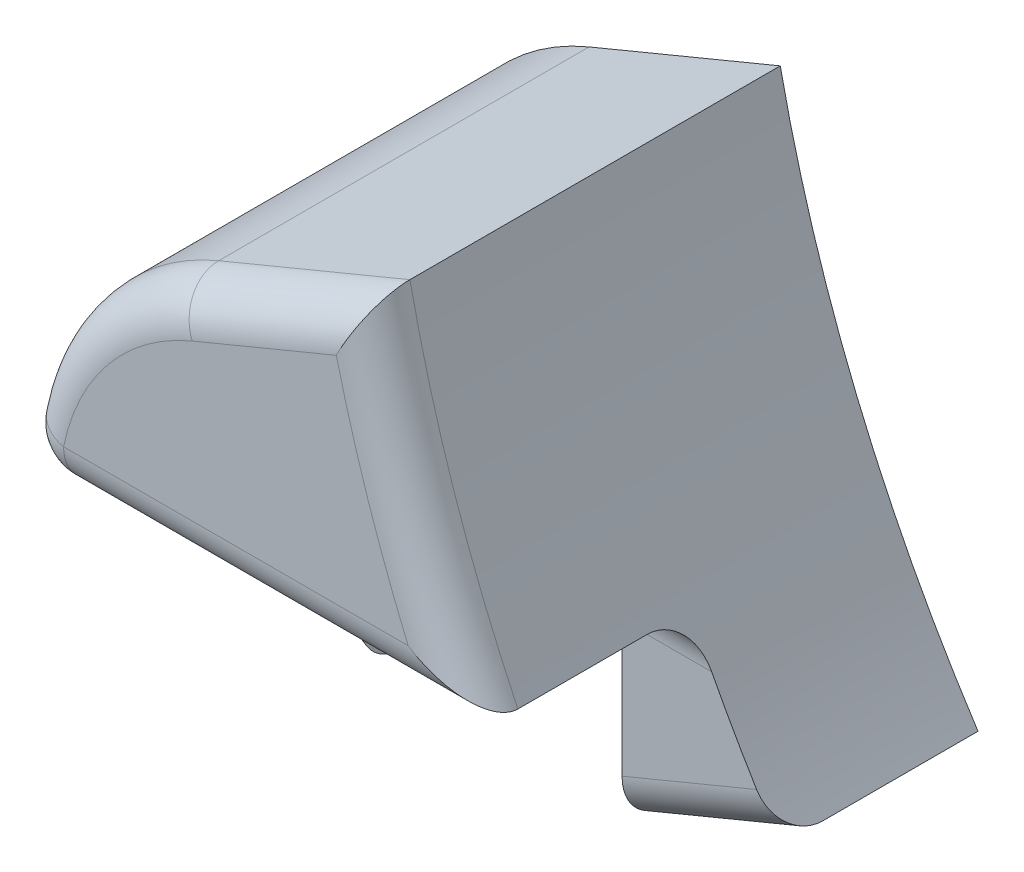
ISO-10303-21;
HEADER;
FILE_DESCRIPTION(('STEP AP214'),'2;1');
FILE_NAME('part.step','',(''),(''),'','','');
FILE_SCHEMA(('AUTOMOTIVE_DESIGN { 1 0 10303 214 1 1 1 1 }'));
ENDSEC;
DATA;
#1=APPLICATION_CONTEXT('core data for automotive mechanical design processes');
#2=APPLICATION_PROTOCOL_DEFINITION('international standard','automotive_design',2000,#1);
#3=PRODUCT_CONTEXT('',#1,'mechanical');
#4=PRODUCT('Part','Part','',(#3));
#5=PRODUCT_RELATED_PRODUCT_CATEGORY('part','',(#4));
#6=PRODUCT_DEFINITION_FORMATION('','',#4);
#7=PRODUCT_DEFINITION_CONTEXT('part definition',#1,'design');
#8=PRODUCT_DEFINITION('design','',#6,#7);
#9=PRODUCT_DEFINITION_SHAPE('','',#8);
#10=(LENGTH_UNIT() NAMED_UNIT(*) SI_UNIT(.MILLI.,.METRE.));
#11=(NAMED_UNIT(*) PLANE_ANGLE_UNIT() SI_UNIT($,.RADIAN.));
#12=(NAMED_UNIT(*) SI_UNIT($,.STERADIAN.) SOLID_ANGLE_UNIT());
#13=UNCERTAINTY_MEASURE_WITH_UNIT(LENGTH_MEASURE(1.E-05),#10,'distance_accuracy_value','');
#14=(GEOMETRIC_REPRESENTATION_CONTEXT(3) GLOBAL_UNCERTAINTY_ASSIGNED_CONTEXT((#13)) GLOBAL_UNIT_ASSIGNED_CONTEXT((#10,
#11,#12)) REPRESENTATION_CONTEXT('',''));
#15=CARTESIAN_POINT('',(0.,0.,0.));
#16=DIRECTION('',(0.,0.,1.));
#17=DIRECTION('',(1.,0.,0.));
#18=AXIS2_PLACEMENT_3D('',#15,#16,#17);
#19=CARTESIAN_POINT('',(-85.9818602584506,-97.4735668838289,30.48));
#20=DIRECTION('',(-0.382683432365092,0.923879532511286,0.));
#21=DIRECTION('',(0.923879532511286,0.382683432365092,0.));
#22=AXIS2_PLACEMENT_3D('',#19,#20,#21);
#23=PLANE('',#22);
#24=DIRECTION('',(0.,0.,-1.));
#25=VECTOR('',#24,1.);
#26=CARTESIAN_POINT('',(-83.5219796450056,-96.4546509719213,30.48));
#27=LINE('',#26,#25);
#28=CARTESIAN_POINT('',(-83.5219796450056,-96.4546509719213,11.43));
#29=VERTEX_POINT('',#28);
#30=CARTESIAN_POINT('',(-83.5219796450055,-96.4546509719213,0.));
#31=VERTEX_POINT('',#30);
#32=EDGE_CURVE('E574',#29,#31,#27,.T.);
#33=ORIENTED_EDGE('',*,*,#32,.T.);
#34=DIRECTION('',(-0.923879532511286,-0.382683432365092,0.));
#35=VECTOR('',#34,1.);
#36=CARTESIAN_POINT('',(-85.9818602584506,-97.4735668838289,0.));
#37=LINE('',#36,#35);
#38=CARTESIAN_POINT('',(-71.8834623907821,-91.6338192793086,0.));
#39=VERTEX_POINT('',#38);
#40=EDGE_CURVE('E284',#39,#31,#37,.T.);
#41=ORIENTED_EDGE('',*,*,#40,.F.);
#42=DIRECTION('',(0.,0.,-1.));
#43=VECTOR('',#42,1.);
#44=CARTESIAN_POINT('',(-71.8834623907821,-91.6338192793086,30.48));
#45=LINE('',#44,#43);
#46=CARTESIAN_POINT('',(-71.8834623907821,-91.6338192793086,11.43));
#47=VERTEX_POINT('',#46);
#48=EDGE_CURVE('E286',#47,#39,#45,.T.);
#49=ORIENTED_EDGE('',*,*,#48,.F.);
#50=DIRECTION('',(-0.923879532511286,-0.382683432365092,0.));
#51=VECTOR('',#50,1.);
#52=CARTESIAN_POINT('',(-71.8834623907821,-91.6338192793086,11.43));
#53=LINE('',#52,#51);
#54=EDGE_CURVE('E521',#29,#47,#53,.F.);
#55=ORIENTED_EDGE('',*,*,#54,.F.);
#56=EDGE_LOOP('',(#33,#41,#49,#55));
#57=FACE_BOUND('',#56,.T.);
#58=ADVANCED_FACE('F37',(#57),#23,.F.);
#59=CARTESIAN_POINT('',(-93.2719796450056,-79.8736617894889,30.48));
#60=DIRECTION('',(0.,0.,-1.));
#61=DIRECTION('',(-0.707106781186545,-0.70710678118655,0.));
#62=AXIS2_PLACEMENT_3D('',#59,#60,#61);
#63=CYLINDRICAL_SURFACE('',#62,19.05);
#64=CARTESIAN_POINT('',(-112.017057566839,-76.4788784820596,19.8475229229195));
#65=CARTESIAN_POINT('',(-112.650129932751,-79.9745333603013,18.6042838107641));
#66=CARTESIAN_POINT('',(-108.8928779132,-80.0466687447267,18.8137614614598));
#67=CARTESIAN_POINT('',(-112.004620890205,-76.4103303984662,19.6816967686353));
#68=CARTESIAN_POINT('',(-112.659950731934,-79.9556491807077,18.5303714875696));
#69=CARTESIAN_POINT('',(-108.882514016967,-80.0181070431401,18.7308483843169));
#70=CARTESIAN_POINT('',(-111.993335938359,-76.350044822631,19.5134350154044));
#71=CARTESIAN_POINT('',(-112.668940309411,-79.9400659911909,18.4583713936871));
#72=CARTESIAN_POINT('',(-108.873109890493,-79.992988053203,18.6467175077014));
#73=CARTESIAN_POINT('',(-111.973534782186,-76.246355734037,19.1732237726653));
#74=CARTESIAN_POINT('',(-112.684870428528,-79.9143441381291,18.3169957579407));
#75=CARTESIAN_POINT('',(-108.856608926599,-79.9497842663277,18.4766118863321));
#76=CARTESIAN_POINT('',(-111.965018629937,-76.2029525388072,19.0012742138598));
#77=CARTESIAN_POINT('',(-112.691790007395,-79.9042496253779,18.2477312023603));
#78=CARTESIAN_POINT('',(-108.849512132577,-79.9316996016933,18.3906371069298));
#79=CARTESIAN_POINT('',(-111.951228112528,-76.1334243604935,18.655058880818));
#80=CARTESIAN_POINT('',(-112.703085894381,-79.8885104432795,18.1113884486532));
#81=CARTESIAN_POINT('',(-108.838020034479,-79.902729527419,18.2175294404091));
#82=CARTESIAN_POINT('',(-111.945950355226,-76.1072812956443,18.4807957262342));
#83=CARTESIAN_POINT('',(-112.707447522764,-79.882888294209,18.0444224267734));
#84=CARTESIAN_POINT('',(-108.833621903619,-79.8918365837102,18.1303978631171));
#85=CARTESIAN_POINT('',(-111.938881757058,-76.0723995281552,18.1310239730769));
#86=CARTESIAN_POINT('',(-112.713311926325,-79.875457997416,17.9115823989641));
#87=CARTESIAN_POINT('',(-108.827731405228,-79.8773025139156,17.9555119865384));
#88=CARTESIAN_POINT('',(-111.937090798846,-76.0636602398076,17.9555154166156));
#89=CARTESIAN_POINT('',(-112.714804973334,-79.8736624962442,17.8458222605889));
#90=CARTESIAN_POINT('',(-108.82623893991,-79.8736611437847,17.8677577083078));
#91=CARTESIAN_POINT('',(-111.937092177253,-76.0636633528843,17.6029313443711));
#92=CARTESIAN_POINT('',(-112.71480397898,-79.8736610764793,17.7135952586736));
#93=CARTESIAN_POINT('',(-108.826240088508,-79.8736624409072,17.6914656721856));
#94=CARTESIAN_POINT('',(-111.93891636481,-76.0725611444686,17.4258557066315));
#95=CARTESIAN_POINT('',(-112.713283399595,-79.8754870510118,17.6472434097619));
#96=CARTESIAN_POINT('',(-108.827760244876,-79.8773698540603,17.6029278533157));
#97=CARTESIAN_POINT('',(-111.946105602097,-76.1080565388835,17.0729722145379));
#98=CARTESIAN_POINT('',(-112.70731871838,-79.8830585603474,17.5132023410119));
#99=CARTESIAN_POINT('',(-108.83375127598,-79.8921596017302,17.4264861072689));
#100=CARTESIAN_POINT('',(-111.951471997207,-76.1346608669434,16.8971648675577));
#101=CARTESIAN_POINT('',(-112.702883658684,-79.8887923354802,17.4456293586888));
#102=CARTESIAN_POINT('',(-108.838223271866,-79.9032447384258,17.3385824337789));
#103=CARTESIAN_POINT('',(-111.972522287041,-76.2407729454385,16.3737613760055));
#104=CARTESIAN_POINT('',(-112.685678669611,-79.9127666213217,17.2396217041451));
#105=CARTESIAN_POINT('',(-108.855765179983,-79.9474581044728,17.0768806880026));
#106=CARTESIAN_POINT('',(-111.993158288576,-76.3465803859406,16.029736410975));
#107=CARTESIAN_POINT('',(-112.669063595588,-79.937679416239,17.0977584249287));
#108=CARTESIAN_POINT('',(-108.872961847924,-79.991544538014,16.904868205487));
#109=CARTESIAN_POINT('',(-112.043448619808,-76.6249498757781,15.3620360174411));
#110=CARTESIAN_POINT('',(-112.62947452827,-80.0147174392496,16.8007422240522));
#111=CARTESIAN_POINT('',(-108.914870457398,-80.1075318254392,16.571018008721));
#112=CARTESIAN_POINT('',(-112.073095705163,-76.7974583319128,15.0383444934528));
#113=CARTESIAN_POINT('',(-112.606674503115,-80.0663139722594,16.6464534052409));
#114=CARTESIAN_POINT('',(-108.939576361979,-80.179410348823,16.4091722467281));
#115=CARTESIAN_POINT('',(-112.135175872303,-77.2044688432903,14.4193006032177));
#116=CARTESIAN_POINT('',(-112.558666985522,-80.2062370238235,16.3298249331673));
#117=CARTESIAN_POINT('',(-108.991309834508,-80.3489980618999,16.0996503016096));
#118=CARTESIAN_POINT('',(-112.167609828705,-77.4389904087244,14.1239571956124));
#119=CARTESIAN_POINT('',(-112.533551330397,-80.293853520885,16.1679744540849));
#120=CARTESIAN_POINT('',(-109.018338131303,-80.4467153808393,15.9519785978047));
#121=CARTESIAN_POINT('',(-112.228228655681,-77.9672217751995,13.5660292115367));
#122=CARTESIAN_POINT('',(-112.482264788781,-80.5127652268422,15.8460908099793));
#123=CARTESIAN_POINT('',(-109.068853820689,-80.6668117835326,15.6730146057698));
#124=CARTESIAN_POINT('',(-112.256353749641,-78.2616515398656,13.3039129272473));
#125=CARTESIAN_POINT('',(-112.456088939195,-80.6439426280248,15.685996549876));
#126=CARTESIAN_POINT('',(-109.092291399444,-80.7894908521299,15.5419564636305));
#127=CARTESIAN_POINT('',(-112.299753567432,-78.8998254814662,12.8243772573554));
#128=CARTESIAN_POINT('',(-112.402074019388,-80.949677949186,15.3849109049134));
#129=CARTESIAN_POINT('',(-109.128457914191,-81.0553966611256,15.3021886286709));
#130=CARTESIAN_POINT('',(-112.31502962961,-79.2435645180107,12.6069532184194));
#131=CARTESIAN_POINT('',(-112.37419313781,-81.1239758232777,15.2432715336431));
#132=CARTESIAN_POINT('',(-109.141187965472,-81.1986212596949,15.1934766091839));
#133=CARTESIAN_POINT('',(-112.325119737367,-79.9649298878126,12.2262906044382));
#134=CARTESIAN_POINT('',(-112.31471882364,-81.5071968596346,14.9956137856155));
#135=CARTESIAN_POINT('',(-109.149596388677,-81.4991901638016,15.0031453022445));
#136=CARTESIAN_POINT('',(-112.320238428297,-80.3419680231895,12.062285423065));
#137=CARTESIAN_POINT('',(-112.283106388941,-81.7159705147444,14.8882184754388));
#138=CARTESIAN_POINT('',(-109.145528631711,-81.6562893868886,14.9211427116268));
#139=CARTESIAN_POINT('',(-112.285014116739,-81.1223169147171,11.7891073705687));
#140=CARTESIAN_POINT('',(-112.213509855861,-82.1595822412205,14.7175144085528));
#141=CARTESIAN_POINT('',(-109.116175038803,-81.9814347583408,14.7845536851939));
#142=CARTESIAN_POINT('',(-112.25469013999,-81.5256078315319,11.6798936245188));
#143=CARTESIAN_POINT('',(-112.175361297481,-82.3955594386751,14.6534293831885));
#144=CARTESIAN_POINT('',(-109.090905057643,-82.1494726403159,14.7299468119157));
#145=CARTESIAN_POINT('',(-112.167406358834,-82.3274462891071,11.5223651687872));
#146=CARTESIAN_POINT('',(-112.093626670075,-82.8698774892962,14.5778468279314));
#147=CARTESIAN_POINT('',(-109.018168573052,-82.4835719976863,14.6511825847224));
#148=CARTESIAN_POINT('',(-112.111655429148,-82.7254444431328,11.4716205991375));
#149=CARTESIAN_POINT('',(-112.050083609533,-83.1091834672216,14.5639915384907));
#150=CARTESIAN_POINT('',(-108.97170946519,-82.6494045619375,14.625810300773));
#151=CARTESIAN_POINT('',(-111.973711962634,-83.5220850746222,11.4227089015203));
#152=CARTESIAN_POINT('',(-111.95748143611,-83.5874811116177,14.584844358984));
#153=CARTESIAN_POINT('',(-108.856756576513,-82.9813381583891,14.6013544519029));
#154=CARTESIAN_POINT('',(-111.891490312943,-83.9207277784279,11.4245998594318));
#155=CARTESIAN_POINT('',(-111.908067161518,-83.8280629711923,14.6200336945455));
#156=CARTESIAN_POINT('',(-108.788238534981,-83.1474392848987,14.6022999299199));
#157=CARTESIAN_POINT('',(-111.750068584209,-84.5109350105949,11.4653657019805));
#158=CARTESIAN_POINT('',(-111.832603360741,-84.178491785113,14.7074685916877));
#159=CARTESIAN_POINT('',(-108.670387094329,-83.3933589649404,14.6226828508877));
#160=CARTESIAN_POINT('',(-111.69976656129,-84.7068514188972,11.4853724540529));
#161=CARTESIAN_POINT('',(-111.806962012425,-84.2946983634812,14.7428595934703));
#162=CARTESIAN_POINT('',(-108.628468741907,-83.4749908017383,14.632686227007));
#163=CARTESIAN_POINT('',(-111.593607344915,-85.0948505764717,11.5376987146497));
#164=CARTESIAN_POINT('',(-111.755737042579,-84.5227804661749,14.824899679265));
#165=CARTESIAN_POINT('',(-108.540002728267,-83.6366571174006,14.6588493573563));
#166=CARTESIAN_POINT('',(-111.53774941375,-85.2869328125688,11.5700198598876));
#167=CARTESIAN_POINT('',(-111.730113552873,-84.6347971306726,14.8717139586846));
#168=CARTESIAN_POINT('',(-108.493454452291,-83.7166913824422,14.6750099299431));
#169=CARTESIAN_POINT('',(-111.421177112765,-85.6657538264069,11.6464378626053));
#170=CARTESIAN_POINT('',(-111.679697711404,-84.8528944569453,14.9758281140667));
#171=CARTESIAN_POINT('',(-108.39631086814,-83.8745334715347,14.7132189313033));
#172=CARTESIAN_POINT('',(-111.36047174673,-85.8525016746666,11.6905132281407));
#173=CARTESIAN_POINT('',(-111.654873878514,-84.9590911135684,15.0332982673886));
#174=CARTESIAN_POINT('',(-108.34572306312,-83.9523450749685,14.7352566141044));
#175=CARTESIAN_POINT('',(-111.234815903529,-86.2200692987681,11.7899400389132));
#176=CARTESIAN_POINT('',(-111.606835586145,-85.1645862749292,15.1578476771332));
#177=CARTESIAN_POINT('',(-108.241009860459,-84.1054982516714,14.7849700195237));
#178=CARTESIAN_POINT('',(-111.16986713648,-86.4008914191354,11.8452869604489));
#179=CARTESIAN_POINT('',(-111.583606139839,-85.2639487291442,15.2251272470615));
#180=CARTESIAN_POINT('',(-108.186885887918,-84.1808408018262,14.8126434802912));
#181=CARTESIAN_POINT('',(-111.103121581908,-86.5783524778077,11.9060245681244));
#182=CARTESIAN_POINT('',(-111.561781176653,-85.3585461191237,15.2962903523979));
#183=CARTESIAN_POINT('',(-108.131264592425,-84.2547829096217,14.8430122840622));
#184=(BOUNDED_SURFACE() B_SPLINE_SURFACE(3,2,((#64,#65,#66),(#67,#68,#69),(#70,#71,#72),(#73,
#74,#75),(#76,#77,#78),(#79,#80,#81),(#82,#83,#84),(#85,#86,#87),(#88,#89,#90),(#91,#92,#93),
(#94,#95,#96),(#97,#98,#99),(#100,#101,#102),(#103,#104,#105),(#106,#107,#108),(#109,#110,#111),
(#112,#113,#114),(#115,#116,#117),(#118,#119,#120),(#121,#122,#123),(#124,#125,#126),(#127,#128,
#129),(#130,#131,#132),(#133,#134,#135),(#136,#137,#138),(#139,#140,#141),(#142,#143,#144),
(#145,#146,#147),(#148,#149,#150),(#151,#152,#153),(#154,#155,#156),(#157,#158,#159),(#160,#161,
#162),(#163,#164,#165),(#166,#167,#168),(#169,#170,#171),(#172,#173,#174),(#175,#176,#177),
(#178,#179,#180),(#181,#182,#183)),.UNSPECIFIED.,.F.,.F.,.F.) B_SPLINE_SURFACE_WITH_KNOTS((4,2,
2,2,2,2,2,2,2,2,2,2,2,2,2,2,2,2,2,4),(3,3),(0.,0.526938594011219,1.05388709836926,
1.580282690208,2.10666056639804,2.63769666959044,3.16893458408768,4.23008557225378,
5.29038570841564,6.35101982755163,7.42524558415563,8.49935943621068,9.55729970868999,
10.6144495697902,11.6258721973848,12.6384110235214,13.1471960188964,13.6560486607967,
14.1639771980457,14.6717022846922),(0.,1.),
.UNSPECIFIED.) GEOMETRIC_REPRESENTATION_ITEM() RATIONAL_B_SPLINE_SURFACE(((1.,0.644789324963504,
1.),(1.,0.642846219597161,1.),(1.,0.6410952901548,1.),(1.,0.638036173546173,1.),(1.,
0.636727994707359,1.),(1.,0.6346139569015,1.),(1.,0.63380757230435,1.),(1.,0.632728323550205,
1.),(1.,0.632455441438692,1.),(1.,0.632455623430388,1.),(1.,0.632733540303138,1.),(1.,
0.633831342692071,1.),(1.,0.634651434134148,1.),(1.,0.637878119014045,1.),(1.,0.641051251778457,
1.),(1.,0.648917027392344,1.),(1.,0.653608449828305,1.),(1.,0.663776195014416,1.),(1.,
0.669252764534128,1.),(1.,0.680246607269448,1.),(1.,0.685763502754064,1.),(1.,0.695937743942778,
1.),(1.,0.700595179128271,1.),(1.,0.708254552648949,1.),(1.,0.711280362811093,1.),(1.,
0.715222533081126,1.),(1.,0.716140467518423,1.),(1.,0.715536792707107,1.),(1.,0.714118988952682,
1.),(1.,0.708931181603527,1.),(1.,0.705158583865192,1.),(1.,0.697801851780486,1.),(1.,
0.695057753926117,1.),(1.,0.689027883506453,1.),(1.,0.685742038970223,1.),(1.,0.678669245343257,
1.),(1.,0.674883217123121,1.),(1.,0.666848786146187,1.),(1.,0.662600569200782,1.),(1.,
0.658141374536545,1.))) REPRESENTATION_ITEM('') SURFACE());
#185=CARTESIAN_POINT('',(-111.103121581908,-86.5783524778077,11.9060245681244));
#186=CARTESIAN_POINT('',(-111.16986713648,-86.4008914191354,11.8452869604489));
#187=CARTESIAN_POINT('',(-111.234815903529,-86.2200692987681,11.7899400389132));
#188=CARTESIAN_POINT('',(-111.36047174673,-85.8525016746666,11.6905132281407));
#189=CARTESIAN_POINT('',(-111.421177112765,-85.6657538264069,11.6464378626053));
#190=CARTESIAN_POINT('',(-111.53774941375,-85.2869328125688,11.5700198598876));
#191=CARTESIAN_POINT('',(-111.593607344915,-85.0948505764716,11.5376987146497));
#192=CARTESIAN_POINT('',(-111.69976656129,-84.7068514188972,11.4853724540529));
#193=CARTESIAN_POINT('',(-111.750068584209,-84.5109350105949,11.4653657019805));
#194=CARTESIAN_POINT('',(-111.891490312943,-83.9207277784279,11.4245998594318));
#195=CARTESIAN_POINT('',(-111.973711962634,-83.5220850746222,11.4227089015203));
#196=CARTESIAN_POINT('',(-112.111655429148,-82.7254444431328,11.4716205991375));
#197=CARTESIAN_POINT('',(-112.167406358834,-82.3274462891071,11.5223651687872));
#198=CARTESIAN_POINT('',(-112.25469013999,-81.5256078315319,11.6798936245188));
#199=CARTESIAN_POINT('',(-112.285014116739,-81.1223169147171,11.7891073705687));
#200=CARTESIAN_POINT('',(-112.320238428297,-80.3419680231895,12.062285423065));
#201=CARTESIAN_POINT('',(-112.325119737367,-79.9649298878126,12.2262906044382));
#202=CARTESIAN_POINT('',(-112.31502962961,-79.2435645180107,12.6069532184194));
#203=CARTESIAN_POINT('',(-112.299753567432,-78.8998254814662,12.8243772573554));
#204=CARTESIAN_POINT('',(-112.256353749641,-78.2616515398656,13.3039129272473));
#205=CARTESIAN_POINT('',(-112.228228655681,-77.9672217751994,13.5660292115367));
#206=CARTESIAN_POINT('',(-112.167609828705,-77.4389904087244,14.1239571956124));
#207=CARTESIAN_POINT('',(-112.135175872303,-77.2044688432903,14.4193006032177));
#208=CARTESIAN_POINT('',(-112.073095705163,-76.7974583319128,15.0383444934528));
#209=CARTESIAN_POINT('',(-112.043448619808,-76.6249498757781,15.3620360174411));
#210=CARTESIAN_POINT('',(-111.993158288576,-76.3465803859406,16.029736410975));
#211=CARTESIAN_POINT('',(-111.972522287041,-76.2407729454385,16.3737613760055));
#212=CARTESIAN_POINT('',(-111.951471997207,-76.1346608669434,16.8971648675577));
#213=CARTESIAN_POINT('',(-111.946105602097,-76.1080565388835,17.0729722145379));
#214=CARTESIAN_POINT('',(-111.93891636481,-76.0725611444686,17.4258557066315));
#215=CARTESIAN_POINT('',(-111.937092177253,-76.0636633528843,17.6029313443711));
#216=CARTESIAN_POINT('',(-111.937090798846,-76.0636602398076,17.9555154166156));
#217=CARTESIAN_POINT('',(-111.938881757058,-76.0723995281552,18.1310239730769));
#218=CARTESIAN_POINT('',(-111.945950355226,-76.1072812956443,18.4807957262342));
#219=CARTESIAN_POINT('',(-111.951228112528,-76.1334243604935,18.655058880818));
#220=CARTESIAN_POINT('',(-111.965018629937,-76.2029525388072,19.0012742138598));
#221=CARTESIAN_POINT('',(-111.973534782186,-76.246355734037,19.1732237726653));
#222=CARTESIAN_POINT('',(-111.993335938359,-76.350044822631,19.5134350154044));
#223=CARTESIAN_POINT('',(-112.004620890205,-76.4103303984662,19.6816967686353));
#224=CARTESIAN_POINT('',(-112.017057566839,-76.4788784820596,19.8475229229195));
#225=B_SPLINE_CURVE_WITH_KNOTS('',3,(#185,#186,#187,#188,#189,#190,#191,#192,#193,#194,#195,
#196,#197,#198,#199,#200,#201,#202,#203,#204,#205,#206,#207,#208,#209,#210,#211,#212,#213,#214,
#215,#216,#217,#218,#219,#220,#221,#222,#223,#224),.UNSPECIFIED.,.F.,.F.,(4,2,2,2,2,2,2,2,2,2,2,
2,2,2,2,2,2,2,2,4),(0.,0.507725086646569,1.0156536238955,1.52450626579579,2.03329126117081,
3.04583008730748,4.05725271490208,5.11440257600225,6.17234284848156,7.24645670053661,
8.32068245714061,9.38131657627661,10.4416167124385,11.5027677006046,12.0340056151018,
12.5650417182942,13.0914195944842,13.617815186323,14.144763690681,14.6717022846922),.UNSPECIFIED.);
#226=CARTESIAN_POINT('',(-111.937091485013,-83.6836617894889,11.43));
#227=VERTEX_POINT('',#226);
#228=CARTESIAN_POINT('',(-111.937091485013,-76.0636617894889,17.78));
#229=VERTEX_POINT('',#228);
#230=EDGE_CURVE('E543',#227,#229,#225,.T.);
#231=ORIENTED_EDGE('',*,*,#230,.T.);
#232=DIRECTION('',(0.,0.,-1.));
#233=VECTOR('',#232,1.);
#234=CARTESIAN_POINT('',(-111.937091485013,-76.0636617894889,30.48));
#235=LINE('',#234,#233);
#236=CARTESIAN_POINT('',(-111.937091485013,-76.0636617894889,27.305));
#237=VERTEX_POINT('',#236);
#238=EDGE_CURVE('E537',#237,#229,#235,.T.);
#239=ORIENTED_EDGE('',*,*,#238,.F.);
#240=CARTESIAN_POINT('',(-93.2719796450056,-79.8736617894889,27.305));
#241=DIRECTION('',(0.,0.,-1.));
#242=DIRECTION('',(0.707106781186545,0.70710678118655,0.));
#243=AXIS2_PLACEMENT_3D('',#240,#241,#242);
#244=CIRCLE('',#243,19.05);
#245=CARTESIAN_POINT('',(-100.562099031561,-62.2737566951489,27.305));
#246=VERTEX_POINT('',#245);
#247=EDGE_CURVE('E536',#246,#237,#244,.F.);
#248=ORIENTED_EDGE('',*,*,#247,.F.);
#249=DIRECTION('',(0.,0.,-1.));
#250=VECTOR('',#249,1.);
#251=CARTESIAN_POINT('',(-100.562099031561,-62.2737566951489,30.48));
#252=LINE('',#251,#250);
#253=CARTESIAN_POINT('',(-100.562099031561,-62.2737566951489,0.));
#254=VERTEX_POINT('',#253);
#255=EDGE_CURVE('E291',#246,#254,#252,.T.);
#256=ORIENTED_EDGE('',*,*,#255,.T.);
#257=CARTESIAN_POINT('',(-93.2719796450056,-79.8736617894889,0.));
#258=DIRECTION('',(0.,0.,-1.));
#259=DIRECTION('',(0.707106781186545,0.70710678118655,0.));
#260=AXIS2_PLACEMENT_3D('',#257,#258,#259);
#261=CIRCLE('',#260,19.05);
#262=CARTESIAN_POINT('',(-103.021979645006,-96.2394798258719,0.));
#263=VERTEX_POINT('',#262);
#264=EDGE_CURVE('E277',#263,#254,#261,.T.);
#265=ORIENTED_EDGE('',*,*,#264,.F.);
#266=DIRECTION('',(0.,0.,-1.));
#267=VECTOR('',#266,1.);
#268=CARTESIAN_POINT('',(-103.021979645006,-96.2394798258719,30.48));
#269=LINE('',#268,#267);
#270=CARTESIAN_POINT('',(-103.021979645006,-96.2394798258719,11.43));
#271=VERTEX_POINT('',#270);
#272=EDGE_CURVE('E253',#263,#271,#269,.F.);
#273=ORIENTED_EDGE('',*,*,#272,.T.);
#274=CARTESIAN_POINT('',(-93.2719796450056,-79.8736617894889,11.43));
#275=DIRECTION('',(0.,0.,-1.));
#276=DIRECTION('',(0.707106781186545,0.70710678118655,0.));
#277=AXIS2_PLACEMENT_3D('',#274,#275,#276);
#278=CIRCLE('',#277,19.05);
#279=EDGE_CURVE('E538',#227,#271,#278,.F.);
#280=ORIENTED_EDGE('',*,*,#279,.F.);
#281=EDGE_LOOP('',(#231,#239,#248,#256,#265,#273,#280));
#282=FACE_BOUND('',#281,.T.);
#283=ADVANCED_FACE('F393',(#282),#63,.T.);
#284=CARTESIAN_POINT('',(14.5802387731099,-35.1998101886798,14.605));
#285=DIRECTION('',(0.,0.,1.));
#286=DIRECTION('',(0.707106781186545,0.70710678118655,0.));
#287=AXIS2_PLACEMENT_3D('',#284,#285,#286);
#288=PLANE('',#287);
#289=DIRECTION('',(0.,-1.,0.));
#290=VECTOR('',#289,1.);
#291=CARTESIAN_POINT('',(-103.021979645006,-35.1998101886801,14.605));
#292=LINE('',#291,#290);
#293=CARTESIAN_POINT('',(-103.021979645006,-83.0486617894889,14.605));
#294=VERTEX_POINT('',#293);
#295=CARTESIAN_POINT('',(-103.021979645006,-92.4017552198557,14.605));
#296=VERTEX_POINT('',#295);
#297=EDGE_CURVE('E575',#294,#296,#292,.T.);
#298=ORIENTED_EDGE('',*,*,#297,.F.);
#299=DIRECTION('',(1.,0.,0.));
#300=VECTOR('',#299,1.);
#301=CARTESIAN_POINT('',(14.58023877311,-83.0486617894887,14.605));
#302=LINE('',#301,#300);
#303=CARTESIAN_POINT('',(-108.826239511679,-83.0486617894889,14.605));
#304=VERTEX_POINT('',#303);
#305=EDGE_CURVE('E369',#304,#294,#302,.T.);
#306=ORIENTED_EDGE('',*,*,#305,.F.);
#307=CARTESIAN_POINT('',(-93.2719796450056,-79.8736617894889,14.605));
#308=DIRECTION('',(0.,0.,-1.));
#309=DIRECTION('',(0.707106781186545,0.70710678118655,0.));
#310=AXIS2_PLACEMENT_3D('',#307,#308,#309);
#311=CIRCLE('',#310,15.875);
#312=EDGE_CURVE('E701',#296,#304,#311,.T.);
#313=ORIENTED_EDGE('',*,*,#312,.F.);
#314=EDGE_LOOP('',(#298,#306,#313));
#315=FACE_BOUND('',#314,.T.);
#316=ADVANCED_FACE('F617',(#315),#288,.T.);
#317=DIRECTION('',(0.,1.,0.));
#318=VECTOR('',#317,1.);
#319=CARTESIAN_POINT('',(-83.5219796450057,-35.19981018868,14.605));
#320=LINE('',#319,#318);
#321=CARTESIAN_POINT('',(-83.5219796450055,-93.0180557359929,14.605));
#322=VERTEX_POINT('',#321);
#323=CARTESIAN_POINT('',(-83.5219796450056,-83.0486617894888,14.605));
#324=VERTEX_POINT('',#323);
#325=EDGE_CURVE('E569',#322,#324,#320,.T.);
#326=ORIENTED_EDGE('',*,*,#325,.F.);
#327=DIRECTION('',(-0.923879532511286,-0.382683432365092,0.));
#328=VECTOR('',#327,1.);
#329=CARTESIAN_POINT('',(-84.7369995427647,-93.521333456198,14.605));
#330=LINE('',#329,#328);
#331=CARTESIAN_POINT('',(-73.6018987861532,-88.9090237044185,14.605));
#332=VERTEX_POINT('',#331);
#333=EDGE_CURVE('E509',#332,#322,#330,.T.);
#334=ORIENTED_EDGE('',*,*,#333,.F.);
#335=CARTESIAN_POINT('',(14.5802387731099,-35.1998101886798,14.605));
#336=DIRECTION('',(0.,0.,-1.));
#337=DIRECTION('',(0.707106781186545,0.70710678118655,0.));
#338=AXIS2_PLACEMENT_3D('',#335,#336,#337);
#339=CIRCLE('',#338,103.251);
#340=CARTESIAN_POINT('',(-76.9143315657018,-83.0486617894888,14.605));
#341=VERTEX_POINT('',#340);
#342=EDGE_CURVE('E275',#341,#332,#339,.F.);
#343=ORIENTED_EDGE('',*,*,#342,.F.);
#344=DIRECTION('',(1.,0.,0.));
#345=VECTOR('',#344,1.);
#346=CARTESIAN_POINT('',(14.58023877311,-83.0486617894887,14.605));
#347=LINE('',#346,#345);
#348=EDGE_CURVE('E517',#324,#341,#347,.T.);
#349=ORIENTED_EDGE('',*,*,#348,.F.);
#350=EDGE_LOOP('',(#326,#334,#343,#349));
#351=FACE_BOUND('',#350,.T.);
#352=ADVANCED_FACE('F568',(#351),#288,.T.);
#353=CARTESIAN_POINT('',(-10.1268388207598,-79.8736617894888,14.605));
#354=DIRECTION('',(0.,1.,0.));
#355=DIRECTION('',(1.,0.,0.));
#356=AXIS2_PLACEMENT_3D('',#353,#354,#355);
#357=PLANE('',#356);
#358=DIRECTION('',(0.,0.,-1.));
#359=VECTOR('',#358,1.);
#360=CARTESIAN_POINT('',(-78.505828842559,-79.8736617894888,30.48));
#361=LINE('',#360,#359);
#362=CARTESIAN_POINT('',(-78.505828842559,-79.8736617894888,17.78));
#363=VERTEX_POINT('',#362);
#364=CARTESIAN_POINT('',(-78.505828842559,-79.8736617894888,27.305));
#365=VERTEX_POINT('',#364);
#366=EDGE_CURVE('E272',#363,#365,#361,.F.);
#367=ORIENTED_EDGE('',*,*,#366,.T.);
#368=DIRECTION('',(1.,0.,0.));
#369=VECTOR('',#368,1.);
#370=CARTESIAN_POINT('',(-78.5058288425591,-79.8736617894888,27.305));
#371=LINE('',#370,#369);
#372=CARTESIAN_POINT('',(-108.826239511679,-79.8736617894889,27.305));
#373=VERTEX_POINT('',#372);
#374=EDGE_CURVE('E511',#373,#365,#371,.T.);
#375=ORIENTED_EDGE('',*,*,#374,.F.);
#376=DIRECTION('',(0.,0.,-1.));
#377=VECTOR('',#376,1.);
#378=CARTESIAN_POINT('',(-108.826239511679,-79.8736617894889,14.605));
#379=LINE('',#378,#377);
#380=CARTESIAN_POINT('',(-108.826239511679,-79.8736617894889,17.78));
#381=VERTEX_POINT('',#380);
#382=EDGE_CURVE('E505',#381,#373,#379,.F.);
#383=ORIENTED_EDGE('',*,*,#382,.F.);
#384=DIRECTION('',(1.,0.,0.));
#385=VECTOR('',#384,1.);
#386=CARTESIAN_POINT('',(-10.1268388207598,-79.8736617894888,17.78));
#387=LINE('',#386,#385);
#388=CARTESIAN_POINT('',(-103.021979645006,-79.8736617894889,17.78));
#389=VERTEX_POINT('',#388);
#390=EDGE_CURVE('E492',#389,#381,#387,.F.);
#391=ORIENTED_EDGE('',*,*,#390,.F.);
#392=DIRECTION('',(0.,0.,1.));
#393=VECTOR('',#392,1.);
#394=CARTESIAN_POINT('',(-103.021979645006,-79.8736617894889,14.605));
#395=LINE('',#394,#393);
#396=CARTESIAN_POINT('',(-103.021979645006,-79.8736617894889,23.33));
#397=VERTEX_POINT('',#396);
#398=EDGE_CURVE('E300',#389,#397,#395,.T.);
#399=ORIENTED_EDGE('',*,*,#398,.T.);
#400=CARTESIAN_POINT('',(-102.221979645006,-79.8736617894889,23.33));
#401=DIRECTION('',(0.,-1.,0.));
#402=DIRECTION('',(1.,0.,0.));
#403=AXIS2_PLACEMENT_3D('',#400,#401,#402);
#404=CIRCLE('',#403,0.8);
#405=CARTESIAN_POINT('',(-102.221979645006,-79.8736617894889,24.13));
#406=VERTEX_POINT('',#405);
#407=EDGE_CURVE('E600',#406,#397,#404,.T.);
#408=ORIENTED_EDGE('',*,*,#407,.F.);
#409=DIRECTION('',(-1.,0.,0.));
#410=VECTOR('',#409,1.);
#411=CARTESIAN_POINT('',(-10.1268388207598,-79.8736617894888,24.13));
#412=LINE('',#411,#410);
#413=CARTESIAN_POINT('',(-84.3219796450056,-79.8736617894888,24.13));
#414=VERTEX_POINT('',#413);
#415=EDGE_CURVE('E294',#414,#406,#412,.T.);
#416=ORIENTED_EDGE('',*,*,#415,.F.);
#417=CARTESIAN_POINT('',(-84.3219796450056,-79.8736617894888,23.33));
#418=DIRECTION('',(0.,-1.,0.));
#419=DIRECTION('',(1.,0.,0.));
#420=AXIS2_PLACEMENT_3D('',#417,#418,#419);
#421=CIRCLE('',#420,0.8);
#422=CARTESIAN_POINT('',(-83.5219796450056,-79.8736617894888,23.33));
#423=VERTEX_POINT('',#422);
#424=EDGE_CURVE('E595',#423,#414,#421,.T.);
#425=ORIENTED_EDGE('',*,*,#424,.F.);
#426=DIRECTION('',(0.,0.,-1.));
#427=VECTOR('',#426,1.);
#428=CARTESIAN_POINT('',(-83.5219796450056,-79.8736617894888,14.605));
#429=LINE('',#428,#427);
#430=CARTESIAN_POINT('',(-83.5219796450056,-79.8736617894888,17.78));
#431=VERTEX_POINT('',#430);
#432=EDGE_CURVE('E297',#423,#431,#429,.T.);
#433=ORIENTED_EDGE('',*,*,#432,.T.);
#434=DIRECTION('',(1.,0.,0.));
#435=VECTOR('',#434,1.);
#436=CARTESIAN_POINT('',(-10.1268388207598,-79.8736617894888,17.78));
#437=LINE('',#436,#435);
#438=EDGE_CURVE('E506',#363,#431,#437,.F.);
#439=ORIENTED_EDGE('',*,*,#438,.F.);
#440=EDGE_LOOP('',(#367,#375,#383,#391,#399,#408,#416,#425,#433,#439));
#441=FACE_BOUND('',#440,.T.);
#442=ADVANCED_FACE('F503',(#441),#357,.F.);
#443=CARTESIAN_POINT('',(-100.562099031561,-62.2737566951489,30.48));
#444=DIRECTION('',(0.382683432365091,-0.923879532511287,0.));
#445=DIRECTION('',(-0.923879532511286,-0.382683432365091,0.));
#446=AXIS2_PLACEMENT_3D('',#443,#444,#445);
#447=PLANE('',#446);
#448=DIRECTION('',(0.,0.,-1.));
#449=VECTOR('',#448,1.);
#450=CARTESIAN_POINT('',(-86.4637011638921,-56.4340090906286,30.48));
#451=LINE('',#450,#449);
#452=CARTESIAN_POINT('',(-86.4637011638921,-56.4340090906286,27.305));
#453=VERTEX_POINT('',#452);
#454=CARTESIAN_POINT('',(-86.4637011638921,-56.4340090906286,0.));
#455=VERTEX_POINT('',#454);
#456=EDGE_CURVE('E288',#453,#455,#451,.T.);
#457=ORIENTED_EDGE('',*,*,#456,.T.);
#458=DIRECTION('',(0.923879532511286,0.382683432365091,0.));
#459=VECTOR('',#458,1.);
#460=CARTESIAN_POINT('',(-100.562099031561,-62.2737566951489,0.));
#461=LINE('',#460,#459);
#462=EDGE_CURVE('E279',#254,#455,#461,.T.);
#463=ORIENTED_EDGE('',*,*,#462,.F.);
#464=ORIENTED_EDGE('',*,*,#255,.F.);
#465=DIRECTION('',(0.923879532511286,0.382683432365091,0.));
#466=VECTOR('',#465,1.);
#467=CARTESIAN_POINT('',(-100.562099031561,-62.2737566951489,27.305));
#468=LINE('',#467,#466);
#469=EDGE_CURVE('E485',#453,#246,#468,.F.);
#470=ORIENTED_EDGE('',*,*,#469,.F.);
#471=EDGE_LOOP('',(#457,#463,#464,#470));
#472=FACE_BOUND('',#471,.T.);
#473=ADVANCED_FACE('F476',(#472),#447,.F.);
#474=CARTESIAN_POINT('',(14.5802387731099,-35.1998101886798,30.48));
#475=DIRECTION('',(0.,0.,-1.));
#476=DIRECTION('',(-0.707106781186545,-0.70710678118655,0.));
#477=AXIS2_PLACEMENT_3D('',#474,#475,#476);
#478=CYLINDRICAL_SURFACE('',#477,103.251);
#479=ORIENTED_EDGE('',*,*,#48,.T.);
#480=CARTESIAN_POINT('',(14.5802387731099,-35.1998101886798,0.));
#481=DIRECTION('',(0.,0.,1.));
#482=DIRECTION('',(0.707106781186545,0.70710678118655,0.));
#483=AXIS2_PLACEMENT_3D('',#480,#481,#482);
#484=CIRCLE('',#483,103.251);
#485=EDGE_CURVE('E282',#455,#39,#484,.T.);
#486=ORIENTED_EDGE('',*,*,#485,.F.);
#487=ORIENTED_EDGE('',*,*,#456,.F.);
#488=CARTESIAN_POINT('',(14.5802387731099,-35.1998101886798,27.305));
#489=DIRECTION('',(0.,0.,-1.));
#490=DIRECTION('',(0.707106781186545,0.70710678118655,0.));
#491=AXIS2_PLACEMENT_3D('',#488,#489,#490);
#492=CIRCLE('',#491,103.251);
#493=EDGE_CURVE('E486',#365,#453,#492,.T.);
#494=ORIENTED_EDGE('',*,*,#493,.F.);
#495=ORIENTED_EDGE('',*,*,#366,.F.);
#496=CARTESIAN_POINT('',(-76.9143315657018,-83.0486617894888,14.605));
#497=CARTESIAN_POINT('',(-76.9651798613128,-82.9514338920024,14.6050052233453));
#498=CARTESIAN_POINT('',(-77.0158518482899,-82.8541611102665,14.609467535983));
#499=CARTESIAN_POINT('',(-77.116563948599,-82.6600809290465,14.6273595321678));
#500=CARTESIAN_POINT('',(-77.1666038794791,-82.56327366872,14.6407917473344));
#501=CARTESIAN_POINT('',(-77.3155935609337,-82.2739219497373,14.6947207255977));
#502=CARTESIAN_POINT('',(-77.4131224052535,-82.0830038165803,14.7488505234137));
#503=CARTESIAN_POINT('',(-77.6016323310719,-81.711262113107,14.8935126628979));
#504=CARTESIAN_POINT('',(-77.6925986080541,-81.5304615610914,14.9841244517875));
#505=CARTESIAN_POINT('',(-77.8215399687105,-81.2724661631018,15.1463522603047));
#506=CARTESIAN_POINT('',(-77.8632649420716,-81.1886770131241,15.2048054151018));
#507=CARTESIAN_POINT('',(-77.943860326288,-81.0263119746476,15.3302589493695));
#508=CARTESIAN_POINT('',(-77.9827323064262,-80.9477332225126,15.3972545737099));
#509=CARTESIAN_POINT('',(-78.0544146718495,-80.8023984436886,15.5340865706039));
#510=CARTESIAN_POINT('',(-78.0874611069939,-80.735197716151,15.6033279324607));
#511=CARTESIAN_POINT('',(-78.1504408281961,-80.6068049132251,15.748415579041));
#512=CARTESIAN_POINT('',(-78.1803758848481,-80.5456094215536,15.824258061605));
#513=CARTESIAN_POINT('',(-78.2368409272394,-80.4299203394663,15.9821132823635));
#514=CARTESIAN_POINT('',(-78.2633700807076,-80.375428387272,16.0641275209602));
#515=CARTESIAN_POINT('',(-78.3127055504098,-80.2738945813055,16.2336969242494));
#516=CARTESIAN_POINT('',(-78.3355124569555,-80.2268515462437,16.3212512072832));
#517=CARTESIAN_POINT('',(-78.3748104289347,-80.1456624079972,16.4911722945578));
#518=CARTESIAN_POINT('',(-78.3917215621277,-80.1106643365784,16.5730360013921));
#519=CARTESIAN_POINT('',(-78.422201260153,-80.0475122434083,16.7399586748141));
#520=CARTESIAN_POINT('',(-78.4357702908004,-80.0193572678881,16.8250171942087));
#521=CARTESIAN_POINT('',(-78.4593948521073,-79.9702950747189,16.9974983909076));
#522=CARTESIAN_POINT('',(-78.4694569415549,-79.9493743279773,17.0849163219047));
#523=CARTESIAN_POINT('',(-78.4859828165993,-79.9149951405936,17.2615009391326));
#524=CARTESIAN_POINT('',(-78.4924487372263,-79.9015322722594,17.3506665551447));
#525=CARTESIAN_POINT('',(-78.4999950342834,-79.8858160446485,17.4967129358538));
#526=CARTESIAN_POINT('',(-78.502183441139,-79.8812570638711,17.5533003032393));
#527=CARTESIAN_POINT('',(-78.5050995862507,-79.8751813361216,17.6665892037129));
#528=CARTESIAN_POINT('',(-78.505829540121,-79.8736599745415,17.7232904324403));
#529=CARTESIAN_POINT('',(-78.5058288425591,-79.8736617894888,17.78));
#530=B_SPLINE_CURVE_WITH_KNOTS('',3,(#496,#497,#498,#499,#500,#501,#502,#503,#504,#505,#506,
#507,#508,#509,#510,#511,#512,#513,#514,#515,#516,#517,#518,#519,#520,#521,#522,#523,#524,#525,
#526,#527,#528,#529),.UNSPECIFIED.,.F.,.F.,(4,2,2,2,2,2,2,2,2,2,2,2,2,2,2,2,4),(0.,
0.328986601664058,0.658066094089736,1.3180849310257,1.97954894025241,2.31020889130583,
2.64068557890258,2.94624592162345,3.25163141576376,3.55709139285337,3.86250287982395,
4.13401045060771,4.40548015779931,4.67643939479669,4.9472375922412,5.11758378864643,
5.28767100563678),.UNSPECIFIED.);
#531=EDGE_CURVE('E53',#341,#363,#530,.T.);
#532=ORIENTED_EDGE('',*,*,#531,.F.);
#533=ORIENTED_EDGE('',*,*,#342,.T.);
#534=CARTESIAN_POINT('',(-71.8834623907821,-91.6338192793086,11.43));
#535=CARTESIAN_POINT('',(-71.8834563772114,-91.6338269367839,11.5182443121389));
#536=CARTESIAN_POINT('',(-71.8855082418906,-91.6306847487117,11.6064839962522));
#537=CARTESIAN_POINT('',(-71.893681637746,-91.6181599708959,11.7823222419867));
#538=CARTESIAN_POINT('',(-71.899802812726,-91.6087779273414,11.8699208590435));
#539=CARTESIAN_POINT('',(-71.9160583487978,-91.5838486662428,12.0437494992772));
#540=CARTESIAN_POINT('',(-71.9261875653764,-91.5683093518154,12.1299811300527));
#541=CARTESIAN_POINT('',(-71.9503583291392,-91.5311979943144,12.300552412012));
#542=CARTESIAN_POINT('',(-71.9643998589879,-91.5096259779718,12.3848920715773));
#543=CARTESIAN_POINT('',(-72.0122378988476,-91.4360570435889,12.634231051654));
#544=CARTESIAN_POINT('',(-72.0517578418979,-91.3751919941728,12.7956559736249));
#545=CARTESIAN_POINT('',(-72.1446479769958,-91.2316785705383,13.1040688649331));
#546=CARTESIAN_POINT('',(-72.1980178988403,-91.149030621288,13.2510571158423));
#547=CARTESIAN_POINT('',(-72.317351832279,-90.9635078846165,13.5279219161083));
#548=CARTESIAN_POINT('',(-72.3834155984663,-90.8604726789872,13.6576481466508));
#549=CARTESIAN_POINT('',(-72.5257445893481,-90.6374700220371,13.8951201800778));
#550=CARTESIAN_POINT('',(-72.6020122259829,-90.5174985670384,14.0028607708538));
#551=CARTESIAN_POINT('',(-72.7636730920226,-90.2618957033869,14.1950628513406));
#552=CARTESIAN_POINT('',(-72.8491915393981,-90.1260466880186,14.2791293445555));
#553=CARTESIAN_POINT('',(-73.0257467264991,-89.8440040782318,14.4194379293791));
#554=CARTESIAN_POINT('',(-73.1167810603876,-89.6978149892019,14.4756920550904));
#555=CARTESIAN_POINT('',(-73.2739071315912,-89.4440095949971,14.5464219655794));
#556=CARTESIAN_POINT('',(-73.3392913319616,-89.3379738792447,14.5683676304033));
#557=CARTESIAN_POINT('',(-73.4704756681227,-89.1243553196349,14.597656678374));
#558=CARTESIAN_POINT('',(-73.5362751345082,-89.0167747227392,14.605019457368));
#559=CARTESIAN_POINT('',(-73.6018987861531,-88.9090237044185,14.605));
#560=B_SPLINE_CURVE_WITH_KNOTS('',3,(#534,#535,#536,#537,#538,#539,#540,#541,#542,#543,#544,
#545,#546,#547,#548,#549,#550,#551,#552,#553,#554,#555,#556,#557,#558,#559),.UNSPECIFIED.,.F.,
.F.,(4,2,2,2,2,2,2,2,2,2,2,2,4),(0.,0.264644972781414,0.52926678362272,0.793550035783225,
1.05783211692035,1.58607884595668,2.11431527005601,2.6468864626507,3.17958376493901,
3.72070348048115,4.26158885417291,4.64025918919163,5.01842553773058),.UNSPECIFIED.);
#561=EDGE_CURVE('E68',#47,#332,#560,.T.);
#562=ORIENTED_EDGE('',*,*,#561,.F.);
#563=EDGE_LOOP('',(#479,#486,#487,#494,#495,#532,#533,#562));
#564=FACE_BOUND('',#563,.T.);
#565=ADVANCED_FACE('F471',(#564),#478,.F.);
#566=CARTESIAN_POINT('',(-93.2719796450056,-79.8736617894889,30.48));
#567=DIRECTION('',(0.,0.,1.));
#568=DIRECTION('',(0.707106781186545,0.70710678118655,0.));
#569=AXIS2_PLACEMENT_3D('',#566,#567,#568);
#570=PLANE('',#569);
#571=DIRECTION('',(1.,0.,0.));
#572=VECTOR('',#571,1.);
#573=CARTESIAN_POINT('',(-112.321979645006,-76.6986617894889,30.48));
#574=LINE('',#573,#572);
#575=CARTESIAN_POINT('',(-83.4214897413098,-76.6986617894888,30.48));
#576=VERTEX_POINT('',#575);
#577=CARTESIAN_POINT('',(-108.826239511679,-76.6986617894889,30.48));
#578=VERTEX_POINT('',#577);
#579=EDGE_CURVE('E555',#576,#578,#574,.F.);
#580=ORIENTED_EDGE('',*,*,#579,.F.);
#581=CARTESIAN_POINT('',(14.5802387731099,-35.1998101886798,30.48));
#582=DIRECTION('',(0.,0.,-1.));
#583=DIRECTION('',(0.707106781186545,0.70710678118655,0.));
#584=AXIS2_PLACEMENT_3D('',#581,#582,#583);
#585=CIRCLE('',#584,106.426);
#586=CARTESIAN_POINT('',(-88.7196421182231,-60.8050456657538,30.48));
#587=VERTEX_POINT('',#586);
#588=EDGE_CURVE('E551',#587,#576,#585,.F.);
#589=ORIENTED_EDGE('',*,*,#588,.F.);
#590=DIRECTION('',(0.923879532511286,0.382683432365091,0.));
#591=VECTOR('',#590,1.);
#592=CARTESIAN_POINT('',(-85.2486812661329,-59.367326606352,30.48));
#593=LINE('',#592,#591);
#594=CARTESIAN_POINT('',(-99.3470791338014,-65.2070742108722,30.48));
#595=VERTEX_POINT('',#594);
#596=EDGE_CURVE('E553',#595,#587,#593,.T.);
#597=ORIENTED_EDGE('',*,*,#596,.F.);
#598=CARTESIAN_POINT('',(-93.2719796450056,-79.8736617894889,30.48));
#599=DIRECTION('',(0.,0.,-1.));
#600=DIRECTION('',(0.707106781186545,0.70710678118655,0.));
#601=AXIS2_PLACEMENT_3D('',#598,#599,#600);
#602=CIRCLE('',#601,15.875);
#603=EDGE_CURVE('E558',#578,#595,#602,.T.);
#604=ORIENTED_EDGE('',*,*,#603,.F.);
#605=EDGE_LOOP('',(#580,#589,#597,#604));
#606=FACE_BOUND('',#605,.T.);
#607=ADVANCED_FACE('F475',(#606),#570,.T.);
#608=CARTESIAN_POINT('',(-93.2719796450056,-79.8736617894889,0.));
#609=DIRECTION('',(0.,0.,1.));
#610=DIRECTION('',(0.707106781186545,0.70710678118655,0.));
#611=AXIS2_PLACEMENT_3D('',#608,#609,#610);
#612=PLANE('',#611);
#613=CARTESIAN_POINT('',(-93.2719796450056,-79.8736617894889,0.));
#614=DIRECTION('',(0.,0.,1.));
#615=DIRECTION('',(-0.707106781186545,-0.70710678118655,0.));
#616=AXIS2_PLACEMENT_3D('',#613,#614,#615);
#617=CIRCLE('',#616,9.74999999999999);
#618=CARTESIAN_POINT('',(-83.5219796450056,-79.8736617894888,0.));
#619=VERTEX_POINT('',#618);
#620=CARTESIAN_POINT('',(-103.021979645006,-79.8736617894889,0.));
#621=VERTEX_POINT('',#620);
#622=EDGE_CURVE('E241',#619,#621,#617,.T.);
#623=ORIENTED_EDGE('',*,*,#622,.T.);
#624=DIRECTION('',(0.,1.,0.));
#625=VECTOR('',#624,1.);
#626=CARTESIAN_POINT('',(-103.021979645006,-79.8736617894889,0.));
#627=LINE('',#626,#625);
#628=EDGE_CURVE('E248',#263,#621,#627,.T.);
#629=ORIENTED_EDGE('',*,*,#628,.F.);
#630=ORIENTED_EDGE('',*,*,#264,.T.);
#631=ORIENTED_EDGE('',*,*,#462,.T.);
#632=ORIENTED_EDGE('',*,*,#485,.T.);
#633=ORIENTED_EDGE('',*,*,#40,.T.);
#634=DIRECTION('',(0.,-1.,0.));
#635=VECTOR('',#634,1.);
#636=CARTESIAN_POINT('',(-83.5219796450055,-103.638553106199,0.));
#637=LINE('',#636,#635);
#638=EDGE_CURVE('E257',#619,#31,#637,.T.);
#639=ORIENTED_EDGE('',*,*,#638,.F.);
#640=EDGE_LOOP('',(#623,#629,#630,#631,#632,#633,#639));
#641=FACE_BOUND('',#640,.T.);
#642=ADVANCED_FACE('F260',(#641),#612,.F.);
#643=CARTESIAN_POINT('',(-93.2719796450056,-79.8736617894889,3.175));
#644=DIRECTION('',(0.,0.,-1.));
#645=DIRECTION('',(-0.707106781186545,-0.70710678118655,0.));
#646=AXIS2_PLACEMENT_3D('',#643,#644,#645);
#647=CYLINDRICAL_SURFACE('',#646,9.74999999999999);
#648=CARTESIAN_POINT('',(-93.2719796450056,-79.8736617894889,3.175));
#649=DIRECTION('',(0.,0.,1.));
#650=DIRECTION('',(-0.707106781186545,-0.70710678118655,0.));
#651=AXIS2_PLACEMENT_3D('',#648,#649,#650);
#652=CIRCLE('',#651,9.74999999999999);
#653=CARTESIAN_POINT('',(-84.3219796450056,-76.0058458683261,3.175));
#654=VERTEX_POINT('',#653);
#655=CARTESIAN_POINT('',(-89.4041637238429,-70.9236617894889,3.175));
#656=VERTEX_POINT('',#655);
#657=EDGE_CURVE('E266',#654,#656,#652,.T.);
#658=ORIENTED_EDGE('',*,*,#657,.T.);
#659=CARTESIAN_POINT('',(-93.2719796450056,-70.1236617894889,3.175));
#660=VERTEX_POINT('',#659);
#661=EDGE_CURVE('E262',#656,#660,#652,.T.);
#662=ORIENTED_EDGE('',*,*,#661,.T.);
#663=CARTESIAN_POINT('',(-97.1397955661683,-70.9236617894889,3.175));
#664=VERTEX_POINT('',#663);
#665=EDGE_CURVE('E263',#660,#664,#652,.T.);
#666=ORIENTED_EDGE('',*,*,#665,.T.);
#667=CARTESIAN_POINT('',(-102.221979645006,-76.0058458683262,3.175));
#668=VERTEX_POINT('',#667);
#669=EDGE_CURVE('E268',#664,#668,#652,.T.);
#670=ORIENTED_EDGE('',*,*,#669,.T.);
#671=CARTESIAN_POINT('',(-102.221979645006,-76.0058458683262,3.175));
#672=CARTESIAN_POINT('',(-102.248847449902,-76.0680152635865,3.17500950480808));
#673=CARTESIAN_POINT('',(-102.275059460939,-76.1304498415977,3.17635226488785));
#674=CARTESIAN_POINT('',(-102.326138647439,-76.2557511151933,3.18139274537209));
#675=CARTESIAN_POINT('',(-102.351006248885,-76.3186176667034,3.18508971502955));
#676=CARTESIAN_POINT('',(-102.423490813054,-76.5075773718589,3.19923134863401));
#677=CARTESIAN_POINT('',(-102.469075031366,-76.6342285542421,3.21272875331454));
#678=CARTESIAN_POINT('',(-102.554598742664,-76.8881329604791,3.24598618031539));
#679=CARTESIAN_POINT('',(-102.594554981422,-77.0153831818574,3.26572703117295));
#680=CARTESIAN_POINT('',(-102.669031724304,-77.2706631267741,3.31015110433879));
#681=CARTESIAN_POINT('',(-102.703549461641,-77.3986932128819,3.33483682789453));
#682=CARTESIAN_POINT('',(-102.783113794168,-77.7195544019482,3.40140763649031));
#683=CARTESIAN_POINT('',(-102.824777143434,-77.9127303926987,3.44571527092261));
#684=CARTESIAN_POINT('',(-102.89612675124,-78.2997953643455,3.54022431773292));
#685=CARTESIAN_POINT('',(-102.925810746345,-78.4936844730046,3.59042684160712));
#686=CARTESIAN_POINT('',(-102.997178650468,-79.0761636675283,3.74659083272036));
#687=CARTESIAN_POINT('',(-103.021203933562,-79.4656693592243,3.85813270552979));
#688=CARTESIAN_POINT('',(-103.02197348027,-79.8610053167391,3.9713746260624));
#689=CARTESIAN_POINT('',(-103.021979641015,-79.8673336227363,3.97318734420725));
#690=CARTESIAN_POINT('',(-103.021979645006,-79.8736617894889,3.975));
#691=B_SPLINE_CURVE_WITH_KNOTS('',3,(#671,#672,#673,#674,#675,#676,#677,#678,#679,#680,#681,
#682,#683,#684,#685,#686,#687,#688,#689,#690),.UNSPECIFIED.,.F.,.F.,(4,2,2,2,2,2,2,2,2,4),(0.,
0.203137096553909,0.406209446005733,0.811708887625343,1.21597507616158,1.62044627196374,
2.2274602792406,2.83458892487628,4.04851983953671,4.0682682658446),.UNSPECIFIED.);
#692=CARTESIAN_POINT('',(-103.021979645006,-79.8736617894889,3.975));
#693=VERTEX_POINT('',#692);
#694=EDGE_CURVE('E244',#693,#668,#691,.F.);
#695=ORIENTED_EDGE('',*,*,#694,.F.);
#696=DIRECTION('',(0.,0.,1.));
#697=VECTOR('',#696,1.);
#698=CARTESIAN_POINT('',(-103.021979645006,-79.8736617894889,0.));
#699=LINE('',#698,#697);
#700=EDGE_CURVE('E235',#621,#693,#699,.T.);
#701=ORIENTED_EDGE('',*,*,#700,.F.);
#702=ORIENTED_EDGE('',*,*,#622,.F.);
#703=DIRECTION('',(0.,0.,1.));
#704=VECTOR('',#703,1.);
#705=CARTESIAN_POINT('',(-83.5219796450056,-79.8736617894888,0.));
#706=LINE('',#705,#704);
#707=CARTESIAN_POINT('',(-83.5219796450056,-79.8736617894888,3.975));
#708=VERTEX_POINT('',#707);
#709=EDGE_CURVE('E247',#619,#708,#706,.T.);
#710=ORIENTED_EDGE('',*,*,#709,.T.);
#711=CARTESIAN_POINT('',(-84.3219796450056,-76.0058458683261,3.175));
#712=CARTESIAN_POINT('',(-84.2951118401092,-76.0680152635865,3.17500950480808));
#713=CARTESIAN_POINT('',(-84.2688998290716,-76.1304498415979,3.17635226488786));
#714=CARTESIAN_POINT('',(-84.2178206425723,-76.2557511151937,3.18139274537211));
#715=CARTESIAN_POINT('',(-84.1929530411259,-76.3186176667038,3.18508971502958));
#716=CARTESIAN_POINT('',(-84.1204684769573,-76.5075773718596,3.19923134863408));
#717=CARTESIAN_POINT('',(-84.0748842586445,-76.634228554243,3.21272875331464));
#718=CARTESIAN_POINT('',(-83.9893605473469,-76.8881329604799,3.24598618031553));
#719=CARTESIAN_POINT('',(-83.9494043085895,-77.015383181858,3.2657270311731));
#720=CARTESIAN_POINT('',(-83.8749275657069,-77.2706631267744,3.31015110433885));
#721=CARTESIAN_POINT('',(-83.8404098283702,-77.398693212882,3.33483682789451));
#722=CARTESIAN_POINT('',(-83.7608454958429,-77.7195544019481,3.40140763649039));
#723=CARTESIAN_POINT('',(-83.7191821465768,-77.9127303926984,3.445715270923));
#724=CARTESIAN_POINT('',(-83.6478325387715,-78.2997953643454,3.54022431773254));
#725=CARTESIAN_POINT('',(-83.6181485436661,-78.4936844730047,3.59042684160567));
#726=CARTESIAN_POINT('',(-83.5467806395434,-79.0761636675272,3.74659083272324));
#727=CARTESIAN_POINT('',(-83.5227553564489,-79.4656693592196,3.85813270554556));
#728=CARTESIAN_POINT('',(-83.5219858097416,-79.8610053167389,3.97137462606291));
#729=CARTESIAN_POINT('',(-83.5219796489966,-79.8673336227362,3.97318734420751));
#730=CARTESIAN_POINT('',(-83.5219796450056,-79.8736617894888,3.975));
#731=B_SPLINE_CURVE_WITH_KNOTS('',3,(#711,#712,#713,#714,#715,#716,#717,#718,#719,#720,#721,
#722,#723,#724,#725,#726,#727,#728,#729,#730),.UNSPECIFIED.,.F.,.F.,(4,2,2,2,2,2,2,2,2,4),(0.,
0.203137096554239,0.406209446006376,0.811708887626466,1.21597507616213,1.62044627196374,
2.22746027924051,2.83458892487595,4.04851983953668,4.06826826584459),.UNSPECIFIED.);
#732=EDGE_CURVE('E594',#654,#708,#731,.T.);
#733=ORIENTED_EDGE('',*,*,#732,.F.);
#734=EDGE_LOOP('',(#658,#662,#666,#670,#695,#701,#702,#710,#733));
#735=FACE_BOUND('',#734,.T.);
#736=ADVANCED_FACE('F238',(#735),#647,.F.);
#737=CARTESIAN_POINT('',(-93.2719796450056,-79.8736617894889,3.175));
#738=DIRECTION('',(0.,0.,-1.));
#739=DIRECTION('',(-0.707106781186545,-0.70710678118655,0.));
#740=AXIS2_PLACEMENT_3D('',#737,#738,#739);
#741=PLANE('',#740);
#742=ORIENTED_EDGE('',*,*,#657,.F.);
#743=DIRECTION('',(0.,-1.,0.));
#744=VECTOR('',#743,1.);
#745=CARTESIAN_POINT('',(-84.3219796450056,-79.8736617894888,3.175));
#746=LINE('',#745,#744);
#747=CARTESIAN_POINT('',(-84.3219796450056,-70.9236617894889,3.175));
#748=VERTEX_POINT('',#747);
#749=EDGE_CURVE('E303',#748,#654,#746,.T.);
#750=ORIENTED_EDGE('',*,*,#749,.F.);
#751=DIRECTION('',(1.,0.,0.));
#752=VECTOR('',#751,1.);
#753=CARTESIAN_POINT('',(-93.2719796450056,-70.9236617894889,3.175));
#754=LINE('',#753,#752);
#755=EDGE_CURVE('E305',#656,#748,#754,.T.);
#756=ORIENTED_EDGE('',*,*,#755,.F.);
#757=EDGE_LOOP('',(#742,#750,#756));
#758=FACE_BOUND('',#757,.T.);
#759=ADVANCED_FACE('F616',(#758),#741,.F.);
#760=DIRECTION('',(0.,1.,0.));
#761=VECTOR('',#760,1.);
#762=CARTESIAN_POINT('',(-102.221979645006,-79.8736617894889,3.175));
#763=LINE('',#762,#761);
#764=CARTESIAN_POINT('',(-102.221979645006,-70.9236617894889,3.175));
#765=VERTEX_POINT('',#764);
#766=EDGE_CURVE('E588',#668,#765,#763,.T.);
#767=ORIENTED_EDGE('',*,*,#766,.F.);
#768=ORIENTED_EDGE('',*,*,#669,.F.);
#769=DIRECTION('',(1.,0.,0.));
#770=VECTOR('',#769,1.);
#771=CARTESIAN_POINT('',(-93.2719796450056,-70.9236617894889,3.175));
#772=LINE('',#771,#770);
#773=EDGE_CURVE('E586',#765,#664,#772,.T.);
#774=ORIENTED_EDGE('',*,*,#773,.F.);
#775=EDGE_LOOP('',(#767,#768,#774));
#776=FACE_BOUND('',#775,.T.);
#777=ADVANCED_FACE('F584',(#776),#741,.F.);
#778=CARTESIAN_POINT('',(-103.021979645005,-113.783580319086,24.13));
#779=DIRECTION('',(1.,0.,0.));
#780=DIRECTION('',(0.,-1.,0.));
#781=AXIS2_PLACEMENT_3D('',#778,#779,#780);
#782=PLANE('',#781);
#783=ORIENTED_EDGE('',*,*,#272,.F.);
#784=ORIENTED_EDGE('',*,*,#628,.T.);
#785=ORIENTED_EDGE('',*,*,#700,.T.);
#786=DIRECTION('',(0.,1.,0.));
#787=VECTOR('',#786,1.);
#788=CARTESIAN_POINT('',(-103.021979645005,-113.783580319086,3.975));
#789=LINE('',#788,#787);
#790=CARTESIAN_POINT('',(-103.021979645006,-70.9236617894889,3.975));
#791=VERTEX_POINT('',#790);
#792=EDGE_CURVE('E593',#791,#693,#789,.F.);
#793=ORIENTED_EDGE('',*,*,#792,.F.);
#794=DIRECTION('',(0.,0.,-1.));
#795=VECTOR('',#794,1.);
#796=CARTESIAN_POINT('',(-103.021979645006,-70.9236617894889,3.175));
#797=LINE('',#796,#795);
#798=CARTESIAN_POINT('',(-103.021979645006,-70.9236617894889,23.33));
#799=VERTEX_POINT('',#798);
#800=EDGE_CURVE('E1050',#799,#791,#797,.T.);
#801=ORIENTED_EDGE('',*,*,#800,.F.);
#802=DIRECTION('',(0.,1.,0.));
#803=VECTOR('',#802,1.);
#804=CARTESIAN_POINT('',(-103.021979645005,-113.783580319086,23.33));
#805=LINE('',#804,#803);
#806=EDGE_CURVE('E499',#397,#799,#805,.T.);
#807=ORIENTED_EDGE('',*,*,#806,.F.);
#808=ORIENTED_EDGE('',*,*,#398,.F.);
#809=CARTESIAN_POINT('',(-103.021979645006,-83.0486617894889,17.78));
#810=DIRECTION('',(-1.,0.,0.));
#811=DIRECTION('',(0.,-1.,0.));
#812=AXIS2_PLACEMENT_3D('',#809,#810,#811);
#813=CIRCLE('',#812,3.175);
#814=EDGE_CURVE('E467',#294,#389,#813,.F.);
#815=ORIENTED_EDGE('',*,*,#814,.F.);
#816=ORIENTED_EDGE('',*,*,#297,.T.);
#817=CARTESIAN_POINT('',(-103.021979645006,-96.2394798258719,11.43));
#818=CARTESIAN_POINT('',(-103.021979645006,-96.2394945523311,11.509836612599));
#819=CARTESIAN_POINT('',(-103.021979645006,-96.2359750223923,11.5896659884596));
#820=CARTESIAN_POINT('',(-103.021979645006,-96.2219802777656,11.7486896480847));
#821=CARTESIAN_POINT('',(-103.021979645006,-96.2115071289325,11.8278841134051));
#822=CARTESIAN_POINT('',(-103.021979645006,-96.1837729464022,11.9847538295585));
#823=CARTESIAN_POINT('',(-103.021979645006,-96.166538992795,12.0624338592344));
#824=CARTESIAN_POINT('',(-103.021979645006,-96.1255104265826,12.2160214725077));
#825=CARTESIAN_POINT('',(-103.021979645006,-96.1017155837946,12.2919289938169));
#826=CARTESIAN_POINT('',(-103.021979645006,-96.0209131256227,12.5160943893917));
#827=CARTESIAN_POINT('',(-103.021979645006,-95.9544411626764,12.6610522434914));
#828=CARTESIAN_POINT('',(-103.021979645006,-95.7991655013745,12.9384035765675));
#829=CARTESIAN_POINT('',(-103.021979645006,-95.7103462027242,13.0707881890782));
#830=CARTESIAN_POINT('',(-103.021979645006,-95.5091680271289,13.3263618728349));
#831=CARTESIAN_POINT('',(-103.021979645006,-95.3959090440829,13.4488405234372));
#832=CARTESIAN_POINT('',(-103.021979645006,-95.1525874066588,13.6756748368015));
#833=CARTESIAN_POINT('',(-103.021979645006,-95.0225198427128,13.7800251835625));
#834=CARTESIAN_POINT('',(-103.021979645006,-94.7314772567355,13.9822356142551));
#835=CARTESIAN_POINT('',(-103.021979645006,-94.568683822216,14.0774724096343));
#836=CARTESIAN_POINT('',(-103.021979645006,-94.2311606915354,14.2437549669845));
#837=CARTESIAN_POINT('',(-103.021979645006,-94.0564208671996,14.3147798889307));
#838=CARTESIAN_POINT('',(-103.021979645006,-93.6690807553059,14.4431573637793));
#839=CARTESIAN_POINT('',(-103.021979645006,-93.4550575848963,14.4961978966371));
#840=CARTESIAN_POINT('',(-103.021979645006,-93.021952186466,14.571529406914));
#841=CARTESIAN_POINT('',(-103.021979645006,-92.8028749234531,14.5938493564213));
#842=CARTESIAN_POINT('',(-103.021979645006,-92.5229027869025,14.6039210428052));
#843=CARTESIAN_POINT('',(-103.021979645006,-92.4623176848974,14.6050005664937));
#844=CARTESIAN_POINT('',(-103.021979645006,-92.4017552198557,14.605));
#845=B_SPLINE_CURVE_WITH_KNOTS('',3,(#817,#818,#819,#820,#821,#822,#823,#824,#825,#826,#827,
#828,#829,#830,#831,#832,#833,#834,#835,#836,#837,#838,#839,#840,#841,#842,#843,#844),
.UNSPECIFIED.,.F.,.F.,(4,2,2,2,2,2,2,2,2,2,2,2,2,4),(0.,0.239420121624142,0.478769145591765,
0.717169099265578,0.955577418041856,1.43162016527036,1.90799615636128,2.40644779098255,
2.90504534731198,3.46869800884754,4.03283460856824,4.69190319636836,5.35034980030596,
5.53208612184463),.UNSPECIFIED.);
#846=EDGE_CURVE('E541',#271,#296,#845,.T.);
#847=ORIENTED_EDGE('',*,*,#846,.F.);
#848=EDGE_LOOP('',(#783,#784,#785,#793,#801,#807,#808,#815,#816,#847));
#849=FACE_BOUND('',#848,.T.);
#850=ADVANCED_FACE('F251',(#849),#782,.T.);
#851=CARTESIAN_POINT('',(-83.5219796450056,-70.1236617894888,24.13));
#852=DIRECTION('',(-1.,0.,0.));
#853=DIRECTION('',(0.,1.,0.));
#854=AXIS2_PLACEMENT_3D('',#851,#852,#853);
#855=PLANE('',#854);
#856=ORIENTED_EDGE('',*,*,#325,.T.);
#857=CARTESIAN_POINT('',(-83.5219796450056,-83.0486617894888,17.78));
#858=DIRECTION('',(1.,0.,0.));
#859=DIRECTION('',(0.,1.,0.));
#860=AXIS2_PLACEMENT_3D('',#857,#858,#859);
#861=CIRCLE('',#860,3.175);
#862=EDGE_CURVE('E11',#431,#324,#861,.F.);
#863=ORIENTED_EDGE('',*,*,#862,.F.);
#864=ORIENTED_EDGE('',*,*,#432,.F.);
#865=DIRECTION('',(0.,-1.,0.));
#866=VECTOR('',#865,1.);
#867=CARTESIAN_POINT('',(-83.5219796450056,-70.1236617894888,23.33));
#868=LINE('',#867,#866);
#869=CARTESIAN_POINT('',(-83.5219796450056,-70.9236617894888,23.33));
#870=VERTEX_POINT('',#869);
#871=EDGE_CURVE('E591',#870,#423,#868,.T.);
#872=ORIENTED_EDGE('',*,*,#871,.F.);
#873=DIRECTION('',(0.,0.,-1.));
#874=VECTOR('',#873,1.);
#875=CARTESIAN_POINT('',(-83.5219796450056,-70.9236617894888,24.13));
#876=LINE('',#875,#874);
#877=CARTESIAN_POINT('',(-83.5219796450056,-70.9236617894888,3.975));
#878=VERTEX_POINT('',#877);
#879=EDGE_CURVE('E1038',#878,#870,#876,.F.);
#880=ORIENTED_EDGE('',*,*,#879,.F.);
#881=DIRECTION('',(0.,-1.,0.));
#882=VECTOR('',#881,1.);
#883=CARTESIAN_POINT('',(-83.5219796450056,-70.1236617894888,3.975));
#884=LINE('',#883,#882);
#885=EDGE_CURVE('E995',#708,#878,#884,.F.);
#886=ORIENTED_EDGE('',*,*,#885,.F.);
#887=ORIENTED_EDGE('',*,*,#709,.F.);
#888=ORIENTED_EDGE('',*,*,#638,.T.);
#889=ORIENTED_EDGE('',*,*,#32,.F.);
#890=CARTESIAN_POINT('',(-83.5219796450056,-93.0180557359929,11.43));
#891=DIRECTION('',(1.,0.,0.));
#892=DIRECTION('',(0.,1.,0.));
#893=AXIS2_PLACEMENT_3D('',#890,#891,#892);
#894=ELLIPSE('',#893,3.43659523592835,3.175);
#895=EDGE_CURVE('E520',#322,#29,#894,.T.);
#896=ORIENTED_EDGE('',*,*,#895,.F.);
#897=EDGE_LOOP('',(#856,#863,#864,#872,#880,#886,#887,#888,#889,#896));
#898=FACE_BOUND('',#897,.T.);
#899=ADVANCED_FACE('F334',(#898),#855,.T.);
#900=CARTESIAN_POINT('',(14.5802387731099,-35.1998101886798,24.13));
#901=DIRECTION('',(0.,0.,1.));
#902=DIRECTION('',(0.707106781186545,0.70710678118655,0.));
#903=AXIS2_PLACEMENT_3D('',#900,#901,#902);
#904=PLANE('',#903);
#905=DIRECTION('',(1.,0.,0.));
#906=VECTOR('',#905,1.);
#907=CARTESIAN_POINT('',(14.58023877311,-70.9236617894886,24.13));
#908=LINE('',#907,#906);
#909=CARTESIAN_POINT('',(-84.3219796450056,-70.9236617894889,24.13));
#910=VERTEX_POINT('',#909);
#911=CARTESIAN_POINT('',(-102.221979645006,-70.9236617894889,24.13));
#912=VERTEX_POINT('',#911);
#913=EDGE_CURVE('E1046',#910,#912,#908,.F.);
#914=ORIENTED_EDGE('',*,*,#913,.F.);
#915=DIRECTION('',(0.,-1.,0.));
#916=VECTOR('',#915,1.);
#917=CARTESIAN_POINT('',(-84.3219796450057,-35.1998101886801,24.13));
#918=LINE('',#917,#916);
#919=EDGE_CURVE('E1043',#414,#910,#918,.F.);
#920=ORIENTED_EDGE('',*,*,#919,.F.);
#921=ORIENTED_EDGE('',*,*,#415,.T.);
#922=DIRECTION('',(0.,1.,0.));
#923=VECTOR('',#922,1.);
#924=CARTESIAN_POINT('',(-102.221979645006,-35.1998101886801,24.13));
#925=LINE('',#924,#923);
#926=EDGE_CURVE('E1041',#912,#406,#925,.F.);
#927=ORIENTED_EDGE('',*,*,#926,.F.);
#928=EDGE_LOOP('',(#914,#920,#921,#927));
#929=FACE_BOUND('',#928,.T.);
#930=ADVANCED_FACE('F332',(#929),#904,.F.);
#931=CARTESIAN_POINT('',(-103.021979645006,-70.1236617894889,24.13));
#932=DIRECTION('',(0.,-1.,0.));
#933=DIRECTION('',(-1.,0.,0.));
#934=AXIS2_PLACEMENT_3D('',#931,#932,#933);
#935=PLANE('',#934);
#936=DIRECTION('',(1.,0.,0.));
#937=VECTOR('',#936,1.);
#938=CARTESIAN_POINT('',(-103.021979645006,-70.1236617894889,23.33));
#939=LINE('',#938,#937);
#940=CARTESIAN_POINT('',(-102.221979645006,-70.1236617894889,23.33));
#941=VERTEX_POINT('',#940);
#942=CARTESIAN_POINT('',(-84.3219796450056,-70.1236617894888,23.33));
#943=VERTEX_POINT('',#942);
#944=EDGE_CURVE('E1061',#941,#943,#939,.T.);
#945=ORIENTED_EDGE('',*,*,#944,.F.);
#946=DIRECTION('',(0.,0.,-1.));
#947=VECTOR('',#946,1.);
#948=CARTESIAN_POINT('',(-102.221979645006,-70.1236617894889,24.13));
#949=LINE('',#948,#947);
#950=CARTESIAN_POINT('',(-102.221979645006,-70.1236617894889,3.975));
#951=VERTEX_POINT('',#950);
#952=EDGE_CURVE('E320',#951,#941,#949,.F.);
#953=ORIENTED_EDGE('',*,*,#952,.F.);
#954=DIRECTION('',(1.,0.,0.));
#955=VECTOR('',#954,1.);
#956=CARTESIAN_POINT('',(-103.021979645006,-70.1236617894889,3.975));
#957=LINE('',#956,#955);
#958=CARTESIAN_POINT('',(-97.1397955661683,-70.1236617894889,3.975));
#959=VERTEX_POINT('',#958);
#960=EDGE_CURVE('E308',#959,#951,#957,.F.);
#961=ORIENTED_EDGE('',*,*,#960,.F.);
#962=CARTESIAN_POINT('',(-98.199327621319,-70.1236617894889,3.82475183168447));
#963=CARTESIAN_POINT('',(-98.0470159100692,-70.1236617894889,3.38508121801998));
#964=CARTESIAN_POINT('',(-97.9717071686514,-70.5281111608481,3.16769123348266));
#965=CARTESIAN_POINT('',(-97.8963984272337,-70.9325605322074,2.95030124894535));
#966=CARTESIAN_POINT('',(-97.9742390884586,-71.3325110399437,3.175));
#967=CARTESIAN_POINT('',(-98.1652384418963,-70.1236617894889,3.83655390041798));
#968=CARTESIAN_POINT('',(-98.022724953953,-70.1236617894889,3.39914653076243));
#969=CARTESIAN_POINT('',(-97.9508339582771,-70.5211621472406,3.17911326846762));
#970=CARTESIAN_POINT('',(-97.8790684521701,-70.9187023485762,2.95901307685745));
#971=CARTESIAN_POINT('',(-97.9492747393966,-71.3187666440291,3.175));
#972=CARTESIAN_POINT('',(-98.1308456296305,-70.1236617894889,3.84743663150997));
#973=CARTESIAN_POINT('',(-97.9973018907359,-70.1236617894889,3.41270215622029));
#974=CARTESIAN_POINT('',(-97.9287980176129,-70.5143551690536,3.19030609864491));
#975=CARTESIAN_POINT('',(-97.8604217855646,-70.9050851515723,2.96784981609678));
#976=CARTESIAN_POINT('',(-97.923905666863,-71.3049430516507,3.175));
#977=CARTESIAN_POINT('',(-98.0615942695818,-70.1236617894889,3.86753459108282));
#978=CARTESIAN_POINT('',(-97.9447007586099,-70.1236617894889,3.43865844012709));
#979=CARTESIAN_POINT('',(-97.8827660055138,-70.5010192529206,3.21211258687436));
#980=CARTESIAN_POINT('',(-97.8209560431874,-70.878413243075,2.9855073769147));
#981=CARTESIAN_POINT('',(-97.8724475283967,-71.2772062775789,3.175));
#982=CARTESIAN_POINT('',(-98.0267359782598,-70.1236617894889,3.87675070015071));
#983=CARTESIAN_POINT('',(-97.9175262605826,-70.1236617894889,3.45106941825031));
#984=CARTESIAN_POINT('',(-97.8587709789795,-70.494490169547,3.22272654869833));
#985=CARTESIAN_POINT('',(-97.8001447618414,-70.8653516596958,2.99433061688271));
#986=CARTESIAN_POINT('',(-97.8463588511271,-71.2632931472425,3.175));
#987=CARTESIAN_POINT('',(-97.9217972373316,-70.1236617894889,3.90212991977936));
#988=CARTESIAN_POINT('',(-97.8342316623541,-70.1236617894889,3.48638847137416));
#989=CARTESIAN_POINT('',(-97.7844847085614,-70.4753322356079,3.25348516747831));
#990=CARTESIAN_POINT('',(-97.7352455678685,-70.8271339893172,3.02037085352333));
#991=CARTESIAN_POINT('',(-97.7672405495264,-71.2215709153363,3.175));
#992=CARTESIAN_POINT('',(-97.851179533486,-70.1236617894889,3.91608171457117));
#993=CARTESIAN_POINT('',(-97.7757858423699,-70.1236617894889,3.50768937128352));
#994=CARTESIAN_POINT('',(-97.7317832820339,-70.4630977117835,3.27260538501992));
#995=CARTESIAN_POINT('',(-97.688289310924,-70.8026427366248,3.03735814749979));
#996=CARTESIAN_POINT('',(-97.7132318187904,-71.1937089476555,3.175));
#997=CARTESIAN_POINT('',(-97.7099867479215,-70.1236617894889,3.93897665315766));
#998=CARTESIAN_POINT('',(-97.6558305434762,-70.1236617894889,3.54559122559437));
#999=CARTESIAN_POINT('',(-97.6224822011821,-70.4397271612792,3.3076532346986));
#1000=CARTESIAN_POINT('',(-97.5896292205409,-70.7558981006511,3.0695565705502));
#1001=CARTESIAN_POINT('',(-97.603662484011,-71.1385173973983,3.175));
#1002=CARTESIAN_POINT('',(-97.6394201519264,-70.1236617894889,3.94797446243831));
#1003=CARTESIAN_POINT('',(-97.5943509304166,-70.1236617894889,3.56229670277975));
#1004=CARTESIAN_POINT('',(-97.5659331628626,-70.4285803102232,3.32361441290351));
#1005=CARTESIAN_POINT('',(-97.5379947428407,-70.7335873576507,3.08481192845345));
#1006=CARTESIAN_POINT('',(-97.5481262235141,-71.1111853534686,3.175));
#1007=CARTESIAN_POINT('',(-97.4978471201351,-70.1236617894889,3.96195113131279));
#1008=CARTESIAN_POINT('',(-97.4688159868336,-70.1236617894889,3.59173522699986));
#1009=CARTESIAN_POINT('',(-97.4495418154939,-70.4071313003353,3.35269541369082));
#1010=CARTESIAN_POINT('',(-97.4307442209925,-70.6906884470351,3.11353694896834));
#1011=CARTESIAN_POINT('',(-97.4351328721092,-71.0569397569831,3.175));
#1012=CARTESIAN_POINT('',(-97.4268403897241,-70.1236617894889,3.96692691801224));
#1013=CARTESIAN_POINT('',(-97.4047319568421,-70.1236617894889,3.60450885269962));
#1014=CARTESIAN_POINT('',(-97.3896970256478,-70.3968297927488,3.36581305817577));
#1015=CARTESIAN_POINT('',(-97.3751168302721,-70.6700712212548,3.12703074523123));
#1016=CARTESIAN_POINT('',(-97.3776743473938,-71.0300265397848,3.175));
#1017=CARTESIAN_POINT('',(-97.2504391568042,-70.1236617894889,3.97500425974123));
#1018=CARTESIAN_POINT('',(-97.2438000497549,-70.1236617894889,3.63171705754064));
#1019=CARTESIAN_POINT('',(-97.238166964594,-70.3722265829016,3.39503274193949));
#1020=CARTESIAN_POINT('',(-97.2335223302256,-70.6209524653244,3.15815610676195));
#1021=CARTESIAN_POINT('',(-97.2329709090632,-70.964000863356,3.175));
#1022=CARTESIAN_POINT('',(-97.1449516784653,-70.1236617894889,3.97604930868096));
#1023=CARTESIAN_POINT('',(-97.1455292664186,-70.1236617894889,3.64415150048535));
#1024=CARTESIAN_POINT('',(-97.1450268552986,-70.3583875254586,3.40952986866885));
#1025=CARTESIAN_POINT('',(-97.1454293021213,-70.5932389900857,3.17479240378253));
#1026=CARTESIAN_POINT('',(-97.1447069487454,-70.9252550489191,3.175));
#1027=CARTESIAN_POINT('',(-96.9340787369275,-70.1236617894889,3.9720145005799));
#1028=CARTESIAN_POINT('',(-96.9467001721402,-70.1236617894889,3.66235239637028));
#1029=CARTESIAN_POINT('',(-96.9551182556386,-70.3322076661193,3.43330382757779));
#1030=CARTESIAN_POINT('',(-96.9644349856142,-70.540876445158,3.20414529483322));
#1031=CARTESIAN_POINT('',(-96.9648534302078,-70.8495428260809,3.175));
#1032=CARTESIAN_POINT('',(-96.8286933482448,-70.1236617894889,3.96693166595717));
#1033=CARTESIAN_POINT('',(-96.8460405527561,-70.1236617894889,3.66818955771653));
#1034=CARTESIAN_POINT('',(-96.8583480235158,-70.3198675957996,3.44257811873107));
#1035=CARTESIAN_POINT('',(-96.8714658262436,-70.5161679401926,3.21691487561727));
#1036=CARTESIAN_POINT('',(-96.8732622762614,-70.8125772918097,3.175));
#1037=CARTESIAN_POINT('',(-96.5128477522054,-70.1236617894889,3.94412843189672));
#1038=CARTESIAN_POINT('',(-96.5431238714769,-70.1236617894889,3.67724165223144));
#1039=CARTESIAN_POINT('',(-96.5640719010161,-70.2848396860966,3.46360346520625));
#1040=CARTESIAN_POINT('',(-96.5882345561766,-70.446404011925,3.24972355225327));
#1041=CARTESIAN_POINT('',(-96.5937850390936,-70.7048043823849,3.175));
#1042=CARTESIAN_POINT('',(-96.3029356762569,-70.1236617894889,3.91884778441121));
#1043=CARTESIAN_POINT('',(-96.337080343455,-70.1236617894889,3.67232452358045));
#1044=CARTESIAN_POINT('',(-96.3628091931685,-70.2641763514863,3.46852090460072));
#1045=CARTESIAN_POINT('',(-96.3910834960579,-70.4049234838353,3.26473096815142));
#1046=CARTESIAN_POINT('',(-96.4013904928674,-70.6372107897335,3.175));
#1047=CARTESIAN_POINT('',(-95.8829680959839,-70.1236617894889,3.85393853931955));
#1048=CARTESIAN_POINT('',(-95.9216855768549,-70.1236617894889,3.64622648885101));
#1049=CARTESIAN_POINT('',(-95.952909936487,-70.2272570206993,3.46479559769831));
#1050=CARTESIAN_POINT('',(-95.9867084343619,-70.3310808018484,3.28339754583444));
#1051=CARTESIAN_POINT('',(-96.0045328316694,-70.5120649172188,3.175));
#1052=CARTESIAN_POINT('',(-95.6729403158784,-70.1236617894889,3.81414361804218));
#1053=CARTESIAN_POINT('',(-95.711600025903,-70.1236617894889,3.62501101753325));
#1054=CARTESIAN_POINT('',(-95.7442142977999,-70.2110560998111,3.45599162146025));
#1055=CARTESIAN_POINT('',(-95.7787745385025,-70.2985811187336,3.28709798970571));
#1056=CARTESIAN_POINT('',(-95.7999538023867,-70.4546409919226,3.175));
#1057=CARTESIAN_POINT('',(-95.2552180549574,-70.1236617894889,3.7246131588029));
#1058=CARTESIAN_POINT('',(-95.2919780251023,-70.1236617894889,3.57109196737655));
#1059=CARTESIAN_POINT('',(-95.3241835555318,-70.1829487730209,3.42839704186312));
#1060=CARTESIAN_POINT('',(-95.3583097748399,-70.2423637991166,3.28583035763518));
#1061=CARTESIAN_POINT('',(-95.3829703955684,-70.3525135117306,3.175));
#1062=CARTESIAN_POINT('',(-95.0475219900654,-70.1236617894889,3.67488486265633));
#1063=CARTESIAN_POINT('',(-95.0818305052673,-70.1236617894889,3.5384236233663));
#1064=CARTESIAN_POINT('',(-95.1128504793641,-70.1710392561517,3.40961369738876));
#1065=CARTESIAN_POINT('',(-95.145217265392,-70.2184785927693,3.28094576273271));
#1066=CARTESIAN_POINT('',(-95.1705718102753,-70.3078007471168,3.175));
#1067=CARTESIAN_POINT('',(-94.5799301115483,-70.1236617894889,3.55501327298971));
#1068=CARTESIAN_POINT('',(-94.6081268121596,-70.1236617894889,3.45605583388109));
#1069=CARTESIAN_POINT('',(-94.6334271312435,-70.1486598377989,3.35950533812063));
#1070=CARTESIAN_POINT('',(-94.6608557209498,-70.1737584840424,3.26317575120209));
#1071=CARTESIAN_POINT('',(-94.6837853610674,-70.2224865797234,3.175));
#1072=CARTESIAN_POINT('',(-94.3205433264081,-70.1236617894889,3.48292769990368));
#1073=CARTESIAN_POINT('',(-94.3434448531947,-70.1236617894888,3.40396341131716));
#1074=CARTESIAN_POINT('',(-94.3649048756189,-70.1393748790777,3.32618723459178));
#1075=CARTESIAN_POINT('',(-94.3874237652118,-70.1551132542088,3.24854655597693));
#1076=CARTESIAN_POINT('',(-94.4076737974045,-70.1859966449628,3.175));
#1077=CARTESIAN_POINT('',(-93.8041381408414,-70.1236617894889,3.33404091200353));
#1078=CARTESIAN_POINT('',(-93.8165276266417,-70.1236617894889,3.29436701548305));
#1079=CARTESIAN_POINT('',(-93.8278950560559,-70.1269597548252,3.25448947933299));
#1080=CARTESIAN_POINT('',(-93.8402994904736,-70.1302808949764,3.21475622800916));
#1081=CARTESIAN_POINT('',(-93.8516258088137,-70.1369193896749,3.175));
#1082=CARTESIAN_POINT('',(-93.5471146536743,-70.1236617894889,3.25725685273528));
#1083=CARTESIAN_POINT('',(-93.5532743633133,-70.1236617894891,3.23669462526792));
#1084=CARTESIAN_POINT('',(-93.5594105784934,-70.1238084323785,3.21612771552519));
#1085=CARTESIAN_POINT('',(-93.5655706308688,-70.1239554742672,3.19556412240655));
#1086=CARTESIAN_POINT('',(-93.5717058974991,-70.1242499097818,3.175));
#1087=CARTESIAN_POINT('',(-93.2840650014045,-70.1236617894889,3.17861320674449));
#1088=CARTESIAN_POINT('',(-93.2843350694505,-70.1236617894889,3.17770990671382));
#1089=CARTESIAN_POINT('',(-93.2846051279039,-70.1236634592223,3.17680660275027));
#1090=CARTESIAN_POINT('',(-93.2848751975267,-70.1236651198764,3.17590330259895));
#1091=CARTESIAN_POINT('',(-93.2851452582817,-70.1236684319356,3.175));
#1092=CARTESIAN_POINT('',(-93.2780223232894,-70.1236617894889,3.17680660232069));
#1093=CARTESIAN_POINT('',(-93.2781573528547,-70.1236617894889,3.17635495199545));
#1094=CARTESIAN_POINT('',(-93.2782923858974,-70.1236617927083,3.17590330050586));
#1095=CARTESIAN_POINT('',(-93.2784274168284,-70.1236617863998,3.17545165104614));
#1096=CARTESIAN_POINT('',(-93.2785624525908,-70.1236617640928,3.175));
#1097=CARTESIAN_POINT('',(-93.2719796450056,-70.1236617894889,3.175));
#1098=CARTESIAN_POINT('',(-93.2719796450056,-70.1236617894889,3.175));
#1099=CARTESIAN_POINT('',(-93.2719796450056,-70.1236617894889,3.175));
#1100=CARTESIAN_POINT('',(-93.2719796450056,-70.1236617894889,3.175));
#1101=CARTESIAN_POINT('',(-93.2719796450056,-70.1236617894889,3.175));
#1102=(BOUNDED_SURFACE() B_SPLINE_SURFACE(3,2,((#962,#963,#964,#965,#966),(#967,#968,#969,#970,
#971),(#972,#973,#974,#975,#976),(#977,#978,#979,#980,#981),(#982,#983,#984,#985,#986),(#987,
#988,#989,#990,#991),(#992,#993,#994,#995,#996),(#997,#998,#999,#1000,#1001),(#1002,#1003,#1004,
#1005,#1006),(#1007,#1008,#1009,#1010,#1011),(#1012,#1013,#1014,#1015,#1016),(#1017,#1018,#1019,
#1020,#1021),(#1022,#1023,#1024,#1025,#1026),(#1027,#1028,#1029,#1030,#1031),(#1032,#1033,#1034,
#1035,#1036),(#1037,#1038,#1039,#1040,#1041),(#1042,#1043,#1044,#1045,#1046),(#1047,#1048,#1049,
#1050,#1051),(#1052,#1053,#1054,#1055,#1056),(#1057,#1058,#1059,#1060,#1061),(#1062,#1063,#1064,
#1065,#1066),(#1067,#1068,#1069,#1070,#1071),(#1072,#1073,#1074,#1075,#1076),(#1077,#1078,#1079,
#1080,#1081),(#1082,#1083,#1084,#1085,#1086),(#1087,#1088,#1089,#1090,#1091),(#1092,#1093,#1094,
#1095,#1096),(#1097,#1098,#1099,#1100,#1101)),.UNSPECIFIED.,.F.,.F.,
.F.) B_SPLINE_SURFACE_WITH_KNOTS((4,2,2,2,2,2,2,2,2,2,2,2,2,4),(3,2,3),(0.,0.108188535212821,
0.216319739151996,0.432035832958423,0.645321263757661,0.858769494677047,1.1750079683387,
1.49140016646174,2.12489409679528,2.76588803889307,3.40641636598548,4.21394807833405,
5.01868937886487,5.03761026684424),(0.,0.5,1.),
.UNSPECIFIED.) GEOMETRIC_REPRESENTATION_ITEM() RATIONAL_B_SPLINE_SURFACE(((1.,0.864418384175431,
1.,0.864418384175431,1.),(1.,0.866930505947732,1.,0.866930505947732,1.),(1.,0.869380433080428,
1.,0.869380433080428,1.),(1.,0.874160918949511,1.,0.874160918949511,1.),(1.,0.876491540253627,
1.,0.876491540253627,1.),(1.,0.883304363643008,1.,0.883304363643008,1.),(1.,0.887620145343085,
1.,0.887620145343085,1.),(1.,0.895810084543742,1.,0.895810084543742,1.),(1.,0.899688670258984,
1.,0.899688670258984,1.),(1.,0.907108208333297,1.,0.907108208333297,1.),(1.,0.910648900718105,
1.,0.910648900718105,1.),(1.,0.919060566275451,1.,0.919060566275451,1.),(1.,0.923751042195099,
1.,0.923751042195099,1.),(1.,0.932565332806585,1.,0.932565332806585,1.),(1.,0.936688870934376,
1.,0.936688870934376,1.),(1.,0.948327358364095,1.,0.948327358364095,1.),(1.,0.955099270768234,
1.,0.955099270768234,1.),(1.,0.967103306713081,1.,0.967103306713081,1.),(1.,0.972316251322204,
1.,0.972316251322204,1.),(1.,0.981308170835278,1.,0.981308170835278,1.),(1.,0.985088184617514,
1.,0.985088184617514,1.),(1.,0.992165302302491,1.,0.992165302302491,1.),(1.,0.995079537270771,
1.,0.995079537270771,1.),(1.,0.998970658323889,1.,0.998970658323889,1.),(1.,0.999954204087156,
1.,0.999954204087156,1.),(1.,0.99999947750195,1.,0.99999947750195,1.),(1.,0.999999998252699,1.,
0.999999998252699,1.),(1.,1.,1.,1.,1.))) REPRESENTATION_ITEM('') SURFACE());
#1103=CARTESIAN_POINT('',(-98.199327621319,-70.1236617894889,3.82475183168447));
#1104=CARTESIAN_POINT('',(-98.1652384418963,-70.1236617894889,3.83655390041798));
#1105=CARTESIAN_POINT('',(-98.1308456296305,-70.1236617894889,3.84743663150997));
#1106=CARTESIAN_POINT('',(-98.0615942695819,-70.1236617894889,3.86753459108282));
#1107=CARTESIAN_POINT('',(-98.0267359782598,-70.1236617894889,3.87675070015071));
#1108=CARTESIAN_POINT('',(-97.9217972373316,-70.1236617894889,3.90212991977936));
#1109=CARTESIAN_POINT('',(-97.851179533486,-70.1236617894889,3.91608171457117));
#1110=CARTESIAN_POINT('',(-97.7099867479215,-70.1236617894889,3.93897665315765));
#1111=CARTESIAN_POINT('',(-97.6394201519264,-70.1236617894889,3.94797446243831));
#1112=CARTESIAN_POINT('',(-97.4978471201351,-70.1236617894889,3.96195113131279));
#1113=CARTESIAN_POINT('',(-97.4268403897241,-70.1236617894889,3.96692691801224));
#1114=CARTESIAN_POINT('',(-97.2504391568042,-70.1236617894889,3.97500425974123));
#1115=CARTESIAN_POINT('',(-97.1449516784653,-70.1236617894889,3.97604930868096));
#1116=CARTESIAN_POINT('',(-96.9340787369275,-70.1236617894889,3.9720145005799));
#1117=CARTESIAN_POINT('',(-96.8286933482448,-70.1236617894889,3.96693166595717));
#1118=CARTESIAN_POINT('',(-96.5128477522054,-70.1236617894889,3.94412843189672));
#1119=CARTESIAN_POINT('',(-96.3029356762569,-70.1236617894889,3.91884778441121));
#1120=CARTESIAN_POINT('',(-95.8829680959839,-70.1236617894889,3.85393853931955));
#1121=CARTESIAN_POINT('',(-95.6729403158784,-70.1236617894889,3.81414361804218));
#1122=CARTESIAN_POINT('',(-95.2552180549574,-70.1236617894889,3.7246131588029));
#1123=CARTESIAN_POINT('',(-95.0475219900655,-70.1236617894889,3.67488486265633));
#1124=CARTESIAN_POINT('',(-94.5799301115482,-70.1236617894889,3.55501327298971));
#1125=CARTESIAN_POINT('',(-94.3205433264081,-70.1236617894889,3.48292769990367));
#1126=CARTESIAN_POINT('',(-93.8041381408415,-70.1236617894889,3.33404091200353));
#1127=CARTESIAN_POINT('',(-93.5471146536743,-70.1236617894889,3.25725685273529));
#1128=CARTESIAN_POINT('',(-93.2840650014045,-70.1236617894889,3.17861320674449));
#1129=CARTESIAN_POINT('',(-93.2780223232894,-70.1236617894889,3.17680660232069));
#1130=CARTESIAN_POINT('',(-93.2719796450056,-70.1236617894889,3.175));
#1131=B_SPLINE_CURVE_WITH_KNOTS('',3,(#1103,#1104,#1105,#1106,#1107,#1108,#1109,#1110,#1111,
#1112,#1113,#1114,#1115,#1116,#1117,#1118,#1119,#1120,#1121,#1122,#1123,#1124,#1125,#1126,#1127,
#1128,#1129,#1130),.UNSPECIFIED.,.F.,.F.,(4,2,2,2,2,2,2,2,2,2,2,2,2,4),(0.,0.108188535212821,
0.216319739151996,0.432035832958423,0.645321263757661,0.858769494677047,1.1750079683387,
1.49140016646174,2.12489409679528,2.76588803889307,3.40641636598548,4.21394807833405,
5.01868937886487,5.03761026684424),.UNSPECIFIED.);
#1132=EDGE_CURVE('E311',#660,#959,#1131,.F.);
#1133=ORIENTED_EDGE('',*,*,#1132,.F.);
#1134=CARTESIAN_POINT('',(-88.569720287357,-71.3325109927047,3.175));
#1135=CARTESIAN_POINT('',(-88.6475609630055,-70.9325604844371,2.95030129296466));
#1136=CARTESIAN_POINT('',(-88.5722521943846,-70.528111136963,3.16769127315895));
#1137=CARTESIAN_POINT('',(-88.4969434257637,-70.1236617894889,3.38508125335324));
#1138=CARTESIAN_POINT('',(-88.3446316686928,-70.1236617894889,3.82475183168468));
#1139=CARTESIAN_POINT('',(-88.5946845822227,-71.3187666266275,3.175));
#1140=CARTESIAN_POINT('',(-88.6648908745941,-70.9187023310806,2.95901309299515));
#1141=CARTESIAN_POINT('',(-88.5931253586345,-70.5211621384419,3.17911328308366));
#1142=CARTESIAN_POINT('',(-88.5212343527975,-70.1236617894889,3.39914654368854));
#1143=CARTESIAN_POINT('',(-88.3787208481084,-70.1236617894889,3.83655390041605));
#1144=CARTESIAN_POINT('',(-88.6200536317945,-71.3049430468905,3.175));
#1145=CARTESIAN_POINT('',(-88.6835375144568,-70.9050851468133,2.96784982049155));
#1146=CARTESIAN_POINT('',(-88.6151612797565,-70.5143551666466,3.19030610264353));
#1147=CARTESIAN_POINT('',(-88.5466574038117,-70.1236617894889,3.41270215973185));
#1148=CARTESIAN_POINT('',(-88.4131136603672,-70.1236617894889,3.84743663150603));
#1149=CARTESIAN_POINT('',(-88.6715117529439,-71.2772062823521,3.175));
#1150=CARTESIAN_POINT('',(-88.7230032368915,-70.8784132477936,2.98550737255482));
#1151=CARTESIAN_POINT('',(-88.6611932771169,-70.5010192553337,3.21211258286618));
#1152=CARTESIAN_POINT('',(-88.5992585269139,-70.1236617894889,3.43865843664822));
#1153=CARTESIAN_POINT('',(-88.4823650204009,-70.1236617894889,3.86753459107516));
#1154=CARTESIAN_POINT('',(-88.6976004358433,-71.2632931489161,3.175));
#1155=CARTESIAN_POINT('',(-88.7438145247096,-70.8653516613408,2.99433061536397));
#1156=CARTESIAN_POINT('',(-88.6851883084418,-70.4944901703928,3.22272654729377));
#1157=CARTESIAN_POINT('',(-88.6264330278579,-70.1236617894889,3.45106941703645));
#1158=CARTESIAN_POINT('',(-88.5172233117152,-70.1236617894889,3.87675070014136));
#1159=CARTESIAN_POINT('',(-88.776718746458,-71.2215709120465,3.175));
#1160=CARTESIAN_POINT('',(-88.8087137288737,-70.8271339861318,3.02037085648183));
#1161=CARTESIAN_POINT('',(-88.7594745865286,-70.4753322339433,3.25348517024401));
#1162=CARTESIAN_POINT('',(-88.7097276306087,-70.1236617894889,3.48638847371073));
#1163=CARTESIAN_POINT('',(-88.6221620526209,-70.1236617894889,3.90212991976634));
#1164=CARTESIAN_POINT('',(-88.8307274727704,-71.1937089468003,3.175));
#1165=CARTESIAN_POINT('',(-88.855669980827,-70.802642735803,3.0373581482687));
#1166=CARTESIAN_POINT('',(-88.8121760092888,-70.4630977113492,3.2726053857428));
#1167=CARTESIAN_POINT('',(-88.7681734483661,-70.1236617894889,3.50768937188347));
#1168=CARTESIAN_POINT('',(-88.6927797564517,-70.1236617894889,3.91608171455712));
#1169=CARTESIAN_POINT('',(-88.9402968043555,-71.1385173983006,3.175));
#1170=CARTESIAN_POINT('',(-88.9543300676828,-70.7558981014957,3.06955656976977));
#1171=CARTESIAN_POINT('',(-88.9214770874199,-70.4397271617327,3.30765323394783));
#1172=CARTESIAN_POINT('',(-88.888128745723,-70.1236617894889,3.5455912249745));
#1173=CARTESIAN_POINT('',(-88.8339725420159,-70.1236617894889,3.9389766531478));
#1174=CARTESIAN_POINT('',(-88.9958330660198,-71.1111853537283,3.175));
#1175=CARTESIAN_POINT('',(-89.0059645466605,-70.7335873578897,3.08481192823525));
#1176=CARTESIAN_POINT('',(-88.9780261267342,-70.4285803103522,3.32361441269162));
#1177=CARTESIAN_POINT('',(-88.9496083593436,-70.1236617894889,3.56229670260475));
#1178=CARTESIAN_POINT('',(-88.9045391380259,-70.1236617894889,3.94797446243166));
#1179=CARTESIAN_POINT('',(-89.1088264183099,-71.0569397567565,3.175));
#1180=CARTESIAN_POINT('',(-89.1132150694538,-70.6906884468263,3.11353694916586));
#1181=CARTESIAN_POINT('',(-89.09441747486,-70.4071313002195,3.35269541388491));
#1182=CARTESIAN_POINT('',(-89.0751433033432,-70.1236617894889,3.591735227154));
#1183=CARTESIAN_POINT('',(-89.0461121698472,-70.1236617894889,3.96195113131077));
#1184=CARTESIAN_POINT('',(-89.1662849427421,-71.030026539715,3.175));
#1185=CARTESIAN_POINT('',(-89.1688424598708,-70.6700712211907,3.12703074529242));
#1186=CARTESIAN_POINT('',(-89.1542622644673,-70.3968297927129,3.36581305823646));
#1187=CARTESIAN_POINT('',(-89.1392273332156,-70.1236617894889,3.60450885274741));
#1188=CARTESIAN_POINT('',(-89.1171189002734,-70.1236617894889,3.96692691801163));
#1189=CARTESIAN_POINT('',(-89.3109883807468,-70.9640008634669,3.175));
#1190=CARTESIAN_POINT('',(-89.3104369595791,-70.620952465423,3.15815610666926));
#1191=CARTESIAN_POINT('',(-89.3057923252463,-70.3722265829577,3.39503274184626));
#1192=CARTESIAN_POINT('',(-89.3001592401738,-70.1236617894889,3.63171705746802));
#1193=CARTESIAN_POINT('',(-89.2935201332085,-70.1236617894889,3.97500425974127));
#1194=CARTESIAN_POINT('',(-89.3992523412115,-70.9252550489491,3.175));
#1195=CARTESIAN_POINT('',(-89.398529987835,-70.5932389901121,3.17479240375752));
#1196=CARTESIAN_POINT('',(-89.3989324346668,-70.3583875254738,3.40952986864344));
#1197=CARTESIAN_POINT('',(-89.3984300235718,-70.1236617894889,3.64415150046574));
#1198=CARTESIAN_POINT('',(-89.3990076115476,-70.1236617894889,3.97604930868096));
#1199=CARTESIAN_POINT('',(-89.5791058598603,-70.8495428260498,3.175));
#1200=CARTESIAN_POINT('',(-89.579524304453,-70.5408764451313,3.20414529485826));
#1201=CARTESIAN_POINT('',(-89.5888410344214,-70.3322076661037,3.43330382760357));
#1202=CARTESIAN_POINT('',(-89.5972591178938,-70.1236617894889,3.66235239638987));
#1203=CARTESIAN_POINT('',(-89.6098805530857,-70.1236617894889,3.97201450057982));
#1204=CARTESIAN_POINT('',(-89.670697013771,-70.8125772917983,3.175));
#1205=CARTESIAN_POINT('',(-89.6724934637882,-70.5161679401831,3.21691487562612));
#1206=CARTESIAN_POINT('',(-89.6856112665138,-70.319867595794,3.44257811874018));
#1207=CARTESIAN_POINT('',(-89.6979187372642,-70.1236617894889,3.66818955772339));
#1208=CARTESIAN_POINT('',(-89.7152659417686,-70.1236617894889,3.96693166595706));
#1209=CARTESIAN_POINT('',(-89.9501742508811,-70.7048043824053,3.175));
#1210=CARTESIAN_POINT('',(-89.955724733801,-70.4464040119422,3.24972355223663));
#1211=CARTESIAN_POINT('',(-89.9798873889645,-70.2848396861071,3.46360346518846));
#1212=CARTESIAN_POINT('',(-90.0008354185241,-70.1236617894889,3.67724165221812));
#1213=CARTESIAN_POINT('',(-90.0311115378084,-70.1236617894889,3.94412843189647));
#1214=CARTESIAN_POINT('',(-90.1425687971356,-70.6372107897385,3.175));
#1215=CARTESIAN_POINT('',(-90.1528757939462,-70.4049234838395,3.26473096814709));
#1216=CARTESIAN_POINT('',(-90.1811500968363,-70.264176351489,3.46852090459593));
#1217=CARTESIAN_POINT('',(-90.2068789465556,-70.1236617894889,3.67232452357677));
#1218=CARTESIAN_POINT('',(-90.2410236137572,-70.1236617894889,3.91884778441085));
#1219=CARTESIAN_POINT('',(-90.5394264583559,-70.512064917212,3.175));
#1220=CARTESIAN_POINT('',(-90.5572508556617,-70.3310808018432,3.28339754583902));
#1221=CARTESIAN_POINT('',(-90.5910493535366,-70.227257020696,3.4647955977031));
#1222=CARTESIAN_POINT('',(-90.6222737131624,-70.1236617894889,3.64622648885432));
#1223=CARTESIAN_POINT('',(-90.6609911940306,-70.1236617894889,3.85393853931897));
#1224=CARTESIAN_POINT('',(-90.7440054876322,-70.4546409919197,3.175));
#1225=CARTESIAN_POINT('',(-90.7651847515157,-70.2985811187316,3.28709798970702));
#1226=CARTESIAN_POINT('',(-90.7997449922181,-70.2110560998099,3.45599162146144));
#1227=CARTESIAN_POINT('',(-90.8323592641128,-70.1236617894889,3.62501101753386));
#1228=CARTESIAN_POINT('',(-90.8710189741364,-70.1236617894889,3.81414361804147));
#1229=CARTESIAN_POINT('',(-91.160988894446,-70.3525135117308,3.175));
#1230=CARTESIAN_POINT('',(-91.1856495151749,-70.2423637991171,3.285830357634));
#1231=CARTESIAN_POINT('',(-91.2197757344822,-70.1829487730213,3.42839704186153));
#1232=CARTESIAN_POINT('',(-91.2519812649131,-70.1236617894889,3.57109196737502));
#1233=CARTESIAN_POINT('',(-91.2887412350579,-70.1236617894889,3.72461315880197));
#1234=CARTESIAN_POINT('',(-91.373387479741,-70.3078007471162,3.175));
#1235=CARTESIAN_POINT('',(-91.3987420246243,-70.218478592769,3.28094576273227));
#1236=CARTESIAN_POINT('',(-91.4311088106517,-70.1710392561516,3.40961369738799));
#1237=CARTESIAN_POINT('',(-91.4621287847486,-70.1236617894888,3.53842362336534));
#1238=CARTESIAN_POINT('',(-91.4964372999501,-70.1236617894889,3.6748848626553));
#1239=CARTESIAN_POINT('',(-91.8601739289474,-70.2224865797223,3.175));
#1240=CARTESIAN_POINT('',(-91.8831035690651,-70.1737584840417,3.2631757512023));
#1241=CARTESIAN_POINT('',(-91.9105321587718,-70.1486598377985,3.35950533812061));
#1242=CARTESIAN_POINT('',(-91.9358324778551,-70.1236617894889,3.45605583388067));
#1243=CARTESIAN_POINT('',(-91.9640291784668,-70.1236617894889,3.55501327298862));
#1244=CARTESIAN_POINT('',(-92.1362854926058,-70.1859966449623,3.175));
#1245=CARTESIAN_POINT('',(-92.1565355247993,-70.1551132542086,3.2485465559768));
#1246=CARTESIAN_POINT('',(-92.1790544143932,-70.1393748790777,3.32618723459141));
#1247=CARTESIAN_POINT('',(-92.2005144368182,-70.1236617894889,3.4039634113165));
#1248=CARTESIAN_POINT('',(-92.2234159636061,-70.1236617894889,3.48292769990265));
#1249=CARTESIAN_POINT('',(-92.6923334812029,-70.1369193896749,3.175));
#1250=CARTESIAN_POINT('',(-92.7036597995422,-70.1302808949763,3.21475622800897));
#1251=CARTESIAN_POINT('',(-92.7160642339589,-70.1269597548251,3.25448947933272));
#1252=CARTESIAN_POINT('',(-92.7274316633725,-70.1236617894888,3.29436701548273));
#1253=CARTESIAN_POINT('',(-92.7398211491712,-70.1236617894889,3.33404091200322));
#1254=CARTESIAN_POINT('',(-92.9722533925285,-70.1242499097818,3.175));
#1255=CARTESIAN_POINT('',(-92.9783886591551,-70.1239554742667,3.19556412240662));
#1256=CARTESIAN_POINT('',(-92.9845487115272,-70.1238084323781,3.21612771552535));
#1257=CARTESIAN_POINT('',(-92.990684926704,-70.1236617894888,3.23669462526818));
#1258=CARTESIAN_POINT('',(-92.9968446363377,-70.1236617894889,3.25725685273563));
#1259=CARTESIAN_POINT('',(-93.2588140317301,-70.1236684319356,3.175));
#1260=CARTESIAN_POINT('',(-93.259084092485,-70.1236651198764,3.17590330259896));
#1261=CARTESIAN_POINT('',(-93.2593541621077,-70.1236634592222,3.17680660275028));
#1262=CARTESIAN_POINT('',(-93.2596242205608,-70.1236617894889,3.17770990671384));
#1263=CARTESIAN_POINT('',(-93.2598942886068,-70.1236617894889,3.17861320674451));
#1264=CARTESIAN_POINT('',(-93.2653968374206,-70.1236617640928,3.175));
#1265=CARTESIAN_POINT('',(-93.265531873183,-70.1236617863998,3.17545165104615));
#1266=CARTESIAN_POINT('',(-93.2656669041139,-70.1236617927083,3.17590330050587));
#1267=CARTESIAN_POINT('',(-93.2658019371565,-70.1236617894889,3.17635495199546));
#1268=CARTESIAN_POINT('',(-93.2659369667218,-70.1236617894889,3.1768066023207));
#1269=CARTESIAN_POINT('',(-93.2719796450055,-70.1236617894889,3.175));
#1270=CARTESIAN_POINT('',(-93.2719796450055,-70.1236617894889,3.175));
#1271=CARTESIAN_POINT('',(-93.2719796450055,-70.1236617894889,3.175));
#1272=CARTESIAN_POINT('',(-93.2719796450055,-70.1236617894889,3.175));
#1273=CARTESIAN_POINT('',(-93.2719796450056,-70.1236617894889,3.175));
#1274=(BOUNDED_SURFACE() B_SPLINE_SURFACE(3,2,((#1134,#1135,#1136,#1137,#1138),(#1139,#1140,
#1141,#1142,#1143),(#1144,#1145,#1146,#1147,#1148),(#1149,#1150,#1151,#1152,#1153),(#1154,#1155,
#1156,#1157,#1158),(#1159,#1160,#1161,#1162,#1163),(#1164,#1165,#1166,#1167,#1168),(#1169,#1170,
#1171,#1172,#1173),(#1174,#1175,#1176,#1177,#1178),(#1179,#1180,#1181,#1182,#1183),(#1184,#1185,
#1186,#1187,#1188),(#1189,#1190,#1191,#1192,#1193),(#1194,#1195,#1196,#1197,#1198),(#1199,#1200,
#1201,#1202,#1203),(#1204,#1205,#1206,#1207,#1208),(#1209,#1210,#1211,#1212,#1213),(#1214,#1215,
#1216,#1217,#1218),(#1219,#1220,#1221,#1222,#1223),(#1224,#1225,#1226,#1227,#1228),(#1229,#1230,
#1231,#1232,#1233),(#1234,#1235,#1236,#1237,#1238),(#1239,#1240,#1241,#1242,#1243),(#1244,#1245,
#1246,#1247,#1248),(#1249,#1250,#1251,#1252,#1253),(#1254,#1255,#1256,#1257,#1258),(#1259,#1260,
#1261,#1262,#1263),(#1264,#1265,#1266,#1267,#1268),(#1269,#1270,#1271,#1272,#1273)),
.UNSPECIFIED.,.F.,.F.,.F.) B_SPLINE_SURFACE_WITH_KNOTS((4,2,2,2,2,2,2,2,2,2,2,2,2,4),(3,2,3),
(0.,0.108188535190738,0.216319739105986,0.432035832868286,0.645321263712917,0.858769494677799,
1.17500796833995,1.49140016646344,2.12489409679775,2.76588803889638,3.40641636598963,
4.21394807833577,5.01868937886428,5.03761026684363),(0.,0.5,1.),
.UNSPECIFIED.) GEOMETRIC_REPRESENTATION_ITEM() RATIONAL_B_SPLINE_SURFACE(((1.,0.864418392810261,
1.,0.864418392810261,1.),(1.,0.866930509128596,1.,0.866930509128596,1.),(1.,0.869380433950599,
1.,0.869380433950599,1.),(1.,0.874160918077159,1.,0.874160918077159,1.),(1.,0.876491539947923,
1.,0.876491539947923,1.),(1.,0.883304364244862,1.,0.883304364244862,1.),(1.,0.887620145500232,
1.,0.887620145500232,1.),(1.,0.895810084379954,1.,0.895810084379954,1.),(1.,0.899688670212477,
1.,0.899688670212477,1.),(1.,0.907108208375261,1.,0.907108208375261,1.),(1.,0.910648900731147,
1.,0.910648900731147,1.),(1.,0.919060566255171,1.,0.919060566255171,1.),(1.,0.923751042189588,
1.,0.923751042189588,1.),(1.,0.932565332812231,1.,0.932565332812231,1.),(1.,0.936688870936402,
1.,0.936688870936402,1.),(1.,0.948327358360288,1.,0.948327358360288,1.),(1.,0.955099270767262,
1.,0.955099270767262,1.),(1.,0.967103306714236,1.,0.967103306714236,1.),(1.,0.972316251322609,
1.,0.972316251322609,1.),(1.,0.981308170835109,1.,0.981308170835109,1.),(1.,0.985088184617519,
1.,0.985088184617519,1.),(1.,0.992165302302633,1.,0.992165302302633,1.),(1.,0.995079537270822,
1.,0.995079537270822,1.),(1.,0.99897065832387,1.,0.99897065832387,1.),(1.,0.999954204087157,1.,
0.999954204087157,1.),(1.,0.99999947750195,1.,0.99999947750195,1.),(1.,0.999999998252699,1.,
0.999999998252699,1.),(1.,1.,1.,1.,1.))) REPRESENTATION_ITEM('') SURFACE());
#1275=CARTESIAN_POINT('',(-88.3446316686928,-70.1236617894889,3.82475183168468));
#1276=CARTESIAN_POINT('',(-88.3787208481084,-70.1236617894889,3.83655390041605));
#1277=CARTESIAN_POINT('',(-88.4131136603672,-70.1236617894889,3.84743663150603));
#1278=CARTESIAN_POINT('',(-88.4823650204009,-70.1236617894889,3.86753459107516));
#1279=CARTESIAN_POINT('',(-88.5172233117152,-70.1236617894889,3.87675070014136));
#1280=CARTESIAN_POINT('',(-88.6221620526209,-70.1236617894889,3.90212991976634));
#1281=CARTESIAN_POINT('',(-88.6927797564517,-70.1236617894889,3.91608171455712));
#1282=CARTESIAN_POINT('',(-88.8339725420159,-70.1236617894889,3.9389766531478));
#1283=CARTESIAN_POINT('',(-88.9045391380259,-70.1236617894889,3.94797446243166));
#1284=CARTESIAN_POINT('',(-89.0461121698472,-70.1236617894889,3.96195113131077));
#1285=CARTESIAN_POINT('',(-89.1171189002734,-70.1236617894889,3.96692691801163));
#1286=CARTESIAN_POINT('',(-89.2935201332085,-70.1236617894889,3.97500425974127));
#1287=CARTESIAN_POINT('',(-89.3990076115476,-70.1236617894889,3.97604930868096));
#1288=CARTESIAN_POINT('',(-89.6098805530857,-70.1236617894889,3.97201450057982));
#1289=CARTESIAN_POINT('',(-89.7152659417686,-70.1236617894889,3.96693166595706));
#1290=CARTESIAN_POINT('',(-90.0311115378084,-70.1236617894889,3.94412843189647));
#1291=CARTESIAN_POINT('',(-90.2410236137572,-70.1236617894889,3.91884778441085));
#1292=CARTESIAN_POINT('',(-90.6609911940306,-70.1236617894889,3.85393853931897));
#1293=CARTESIAN_POINT('',(-90.8710189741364,-70.1236617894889,3.81414361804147));
#1294=CARTESIAN_POINT('',(-91.2887412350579,-70.1236617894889,3.72461315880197));
#1295=CARTESIAN_POINT('',(-91.4964372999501,-70.1236617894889,3.6748848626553));
#1296=CARTESIAN_POINT('',(-91.9640291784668,-70.1236617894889,3.55501327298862));
#1297=CARTESIAN_POINT('',(-92.2234159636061,-70.1236617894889,3.48292769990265));
#1298=CARTESIAN_POINT('',(-92.7398211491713,-70.1236617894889,3.33404091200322));
#1299=CARTESIAN_POINT('',(-92.9968446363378,-70.1236617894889,3.25725685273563));
#1300=CARTESIAN_POINT('',(-93.2598942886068,-70.1236617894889,3.17861320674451));
#1301=CARTESIAN_POINT('',(-93.2659369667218,-70.1236617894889,3.1768066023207));
#1302=CARTESIAN_POINT('',(-93.2719796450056,-70.1236617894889,3.175));
#1303=B_SPLINE_CURVE_WITH_KNOTS('',3,(#1275,#1276,#1277,#1278,#1279,#1280,#1281,#1282,#1283,
#1284,#1285,#1286,#1287,#1288,#1289,#1290,#1291,#1292,#1293,#1294,#1295,#1296,#1297,#1298,#1299,
#1300,#1301,#1302),.UNSPECIFIED.,.F.,.F.,(4,2,2,2,2,2,2,2,2,2,2,2,2,4),(0.,0.108188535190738,
0.216319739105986,0.432035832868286,0.645321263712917,0.858769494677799,1.17500796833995,
1.49140016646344,2.12489409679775,2.76588803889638,3.40641636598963,4.21394807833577,
5.01868937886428,5.03761026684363),.UNSPECIFIED.);
#1304=CARTESIAN_POINT('',(-89.4041637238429,-70.1236617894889,3.975));
#1305=VERTEX_POINT('',#1304);
#1306=EDGE_CURVE('E1056',#1305,#660,#1303,.T.);
#1307=ORIENTED_EDGE('',*,*,#1306,.F.);
#1308=DIRECTION('',(1.,0.,0.));
#1309=VECTOR('',#1308,1.);
#1310=CARTESIAN_POINT('',(-103.021979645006,-70.1236617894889,3.975));
#1311=LINE('',#1310,#1309);
#1312=CARTESIAN_POINT('',(-84.3219796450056,-70.1236617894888,3.975));
#1313=VERTEX_POINT('',#1312);
#1314=EDGE_CURVE('E1005',#1313,#1305,#1311,.F.);
#1315=ORIENTED_EDGE('',*,*,#1314,.F.);
#1316=DIRECTION('',(0.,0.,-1.));
#1317=VECTOR('',#1316,1.);
#1318=CARTESIAN_POINT('',(-84.3219796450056,-70.1236617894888,3.175));
#1319=LINE('',#1318,#1317);
#1320=EDGE_CURVE('E1054',#943,#1313,#1319,.T.);
#1321=ORIENTED_EDGE('',*,*,#1320,.F.);
#1322=EDGE_LOOP('',(#945,#953,#961,#1133,#1307,#1315,#1321));
#1323=FACE_BOUND('',#1322,.T.);
#1324=ADVANCED_FACE('F326',(#1323),#935,.T.);
#1325=ORIENTED_EDGE('',*,*,#1132,.T.);
#1326=CARTESIAN_POINT('',(-97.1397955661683,-70.9236617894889,3.97500000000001));
#1327=DIRECTION('',(1.,0.,0.));
#1328=DIRECTION('',(0.,1.,0.));
#1329=AXIS2_PLACEMENT_3D('',#1326,#1327,#1328);
#1330=CIRCLE('',#1329,0.8);
#1331=EDGE_CURVE('E1028',#959,#664,#1330,.F.);
#1332=ORIENTED_EDGE('',*,*,#1331,.T.);
#1333=ORIENTED_EDGE('',*,*,#665,.F.);
#1334=EDGE_LOOP('',(#1325,#1332,#1333));
#1335=FACE_BOUND('',#1334,.T.);
#1336=ADVANCED_FACE('F331',(#1335),#1102,.F.);
#1337=CARTESIAN_POINT('',(-102.221979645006,-79.8736617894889,3.975));
#1338=DIRECTION('',(0.,1.,0.));
#1339=DIRECTION('',(1.,0.,0.));
#1340=AXIS2_PLACEMENT_3D('',#1337,#1338,#1339);
#1341=CYLINDRICAL_SURFACE('',#1340,0.8);
#1342=ORIENTED_EDGE('',*,*,#694,.T.);
#1343=ORIENTED_EDGE('',*,*,#766,.T.);
#1344=CARTESIAN_POINT('',(-102.221979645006,-70.9236617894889,3.975));
#1345=DIRECTION('',(0.,1.,0.));
#1346=DIRECTION('',(-1.,0.,0.));
#1347=AXIS2_PLACEMENT_3D('',#1344,#1345,#1346);
#1348=CIRCLE('',#1347,0.8);
#1349=EDGE_CURVE('E1027',#765,#791,#1348,.T.);
#1350=ORIENTED_EDGE('',*,*,#1349,.T.);
#1351=ORIENTED_EDGE('',*,*,#792,.T.);
#1352=EDGE_LOOP('',(#1342,#1343,#1350,#1351));
#1353=FACE_BOUND('',#1352,.T.);
#1354=ADVANCED_FACE('F352',(#1353),#1341,.F.);
#1355=CARTESIAN_POINT('',(-93.2719796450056,-70.9236617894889,3.975));
#1356=DIRECTION('',(1.,0.,0.));
#1357=DIRECTION('',(0.,-1.,0.));
#1358=AXIS2_PLACEMENT_3D('',#1355,#1356,#1357);
#1359=CYLINDRICAL_SURFACE('',#1358,0.8);
#1360=ORIENTED_EDGE('',*,*,#1331,.F.);
#1361=ORIENTED_EDGE('',*,*,#960,.T.);
#1362=CARTESIAN_POINT('',(-102.221979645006,-70.9236617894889,3.975));
#1363=DIRECTION('',(-1.,0.,0.));
#1364=DIRECTION('',(0.,-1.,0.));
#1365=AXIS2_PLACEMENT_3D('',#1362,#1363,#1364);
#1366=CIRCLE('',#1365,0.8);
#1367=EDGE_CURVE('E1025',#951,#765,#1366,.T.);
#1368=ORIENTED_EDGE('',*,*,#1367,.T.);
#1369=ORIENTED_EDGE('',*,*,#773,.T.);
#1370=EDGE_LOOP('',(#1360,#1361,#1368,#1369));
#1371=FACE_BOUND('',#1370,.T.);
#1372=ADVANCED_FACE('F682',(#1371),#1359,.F.);
#1373=CARTESIAN_POINT('',(-102.221979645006,-70.9236617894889,3.975));
#1374=DIRECTION('',(0.,0.,1.));
#1375=DIRECTION('',(0.707106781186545,0.70710678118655,0.));
#1376=AXIS2_PLACEMENT_3D('',#1373,#1374,#1375);
#1377=SPHERICAL_SURFACE('',#1376,0.8);
#1378=ORIENTED_EDGE('',*,*,#1367,.F.);
#1379=CARTESIAN_POINT('',(-102.221979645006,-70.9236617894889,3.975));
#1380=DIRECTION('',(0.,0.,-1.));
#1381=DIRECTION('',(0.707106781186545,0.70710678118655,0.));
#1382=AXIS2_PLACEMENT_3D('',#1379,#1380,#1381);
#1383=CIRCLE('',#1382,0.8);
#1384=EDGE_CURVE('E1023',#951,#791,#1383,.F.);
#1385=ORIENTED_EDGE('',*,*,#1384,.T.);
#1386=ORIENTED_EDGE('',*,*,#1349,.F.);
#1387=EDGE_LOOP('',(#1378,#1385,#1386));
#1388=FACE_BOUND('',#1387,.T.);
#1389=ADVANCED_FACE('F679',(#1388),#1377,.F.);
#1390=CARTESIAN_POINT('',(-102.221979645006,-113.783580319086,23.33));
#1391=DIRECTION('',(0.,1.,0.));
#1392=DIRECTION('',(1.,0.,0.));
#1393=AXIS2_PLACEMENT_3D('',#1390,#1391,#1392);
#1394=CYLINDRICAL_SURFACE('',#1393,0.8);
#1395=ORIENTED_EDGE('',*,*,#407,.T.);
#1396=ORIENTED_EDGE('',*,*,#806,.T.);
#1397=CARTESIAN_POINT('',(-102.221979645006,-70.9236617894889,23.33));
#1398=DIRECTION('',(0.,1.,0.));
#1399=DIRECTION('',(-1.,0.,0.));
#1400=AXIS2_PLACEMENT_3D('',#1397,#1398,#1399);
#1401=CIRCLE('',#1400,0.8);
#1402=EDGE_CURVE('E1020',#799,#912,#1401,.T.);
#1403=ORIENTED_EDGE('',*,*,#1402,.T.);
#1404=ORIENTED_EDGE('',*,*,#926,.T.);
#1405=EDGE_LOOP('',(#1395,#1396,#1403,#1404));
#1406=FACE_BOUND('',#1405,.T.);
#1407=ADVANCED_FACE('F675',(#1406),#1394,.F.);
#1408=CARTESIAN_POINT('',(-102.221979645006,-70.9236617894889,24.13));
#1409=DIRECTION('',(0.,0.,1.));
#1410=DIRECTION('',(0.707106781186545,0.70710678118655,0.));
#1411=AXIS2_PLACEMENT_3D('',#1408,#1409,#1410);
#1412=CYLINDRICAL_SURFACE('',#1411,0.8);
#1413=ORIENTED_EDGE('',*,*,#1384,.F.);
#1414=ORIENTED_EDGE('',*,*,#952,.T.);
#1415=CARTESIAN_POINT('',(-102.221979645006,-70.9236617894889,23.33));
#1416=DIRECTION('',(0.,0.,1.));
#1417=DIRECTION('',(-0.707106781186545,-0.70710678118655,0.));
#1418=AXIS2_PLACEMENT_3D('',#1415,#1416,#1417);
#1419=CIRCLE('',#1418,0.8);
#1420=EDGE_CURVE('E1018',#941,#799,#1419,.T.);
#1421=ORIENTED_EDGE('',*,*,#1420,.T.);
#1422=ORIENTED_EDGE('',*,*,#800,.T.);
#1423=EDGE_LOOP('',(#1413,#1414,#1421,#1422));
#1424=FACE_BOUND('',#1423,.T.);
#1425=ADVANCED_FACE('F671',(#1424),#1412,.F.);
#1426=CARTESIAN_POINT('',(-102.221979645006,-70.9236617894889,23.33));
#1427=DIRECTION('',(0.,0.,1.));
#1428=DIRECTION('',(0.707106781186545,0.70710678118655,0.));
#1429=AXIS2_PLACEMENT_3D('',#1426,#1427,#1428);
#1430=SPHERICAL_SURFACE('',#1429,0.8);
#1431=ORIENTED_EDGE('',*,*,#1420,.F.);
#1432=CARTESIAN_POINT('',(-102.221979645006,-70.9236617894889,23.33));
#1433=DIRECTION('',(-1.,0.,0.));
#1434=DIRECTION('',(0.,-1.,0.));
#1435=AXIS2_PLACEMENT_3D('',#1432,#1433,#1434);
#1436=CIRCLE('',#1435,0.8);
#1437=EDGE_CURVE('E1016',#941,#912,#1436,.F.);
#1438=ORIENTED_EDGE('',*,*,#1437,.T.);
#1439=ORIENTED_EDGE('',*,*,#1402,.F.);
#1440=EDGE_LOOP('',(#1431,#1438,#1439));
#1441=FACE_BOUND('',#1440,.T.);
#1442=ADVANCED_FACE('F667',(#1441),#1430,.F.);
#1443=CARTESIAN_POINT('',(-84.3219796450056,-70.1236617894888,23.33));
#1444=DIRECTION('',(0.,-1.,0.));
#1445=DIRECTION('',(-1.,0.,0.));
#1446=AXIS2_PLACEMENT_3D('',#1443,#1444,#1445);
#1447=CYLINDRICAL_SURFACE('',#1446,0.8);
#1448=ORIENTED_EDGE('',*,*,#424,.T.);
#1449=ORIENTED_EDGE('',*,*,#919,.T.);
#1450=CARTESIAN_POINT('',(-84.3219796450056,-70.9236617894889,23.33));
#1451=DIRECTION('',(0.,1.,0.));
#1452=DIRECTION('',(-1.,0.,0.));
#1453=AXIS2_PLACEMENT_3D('',#1450,#1451,#1452);
#1454=CIRCLE('',#1453,0.8);
#1455=EDGE_CURVE('E1013',#910,#870,#1454,.T.);
#1456=ORIENTED_EDGE('',*,*,#1455,.T.);
#1457=ORIENTED_EDGE('',*,*,#871,.T.);
#1458=EDGE_LOOP('',(#1448,#1449,#1456,#1457));
#1459=FACE_BOUND('',#1458,.T.);
#1460=ADVANCED_FACE('F663',(#1459),#1447,.F.);
#1461=CARTESIAN_POINT('',(-103.021979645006,-70.9236617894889,23.33));
#1462=DIRECTION('',(1.,0.,0.));
#1463=DIRECTION('',(0.,-1.,0.));
#1464=AXIS2_PLACEMENT_3D('',#1461,#1462,#1463);
#1465=CYLINDRICAL_SURFACE('',#1464,0.8);
#1466=ORIENTED_EDGE('',*,*,#1437,.F.);
#1467=ORIENTED_EDGE('',*,*,#944,.T.);
#1468=CARTESIAN_POINT('',(-84.3219796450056,-70.9236617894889,23.33));
#1469=DIRECTION('',(1.,0.,0.));
#1470=DIRECTION('',(0.,1.,0.));
#1471=AXIS2_PLACEMENT_3D('',#1468,#1469,#1470);
#1472=CIRCLE('',#1471,0.8);
#1473=EDGE_CURVE('E1011',#943,#910,#1472,.T.);
#1474=ORIENTED_EDGE('',*,*,#1473,.T.);
#1475=ORIENTED_EDGE('',*,*,#913,.T.);
#1476=EDGE_LOOP('',(#1466,#1467,#1474,#1475));
#1477=FACE_BOUND('',#1476,.T.);
#1478=ADVANCED_FACE('F659',(#1477),#1465,.F.);
#1479=CARTESIAN_POINT('',(-84.3219796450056,-70.9236617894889,23.33));
#1480=DIRECTION('',(0.,0.,1.));
#1481=DIRECTION('',(0.707106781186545,0.70710678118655,0.));
#1482=AXIS2_PLACEMENT_3D('',#1479,#1480,#1481);
#1483=SPHERICAL_SURFACE('',#1482,0.8);
#1484=ORIENTED_EDGE('',*,*,#1473,.F.);
#1485=CARTESIAN_POINT('',(-84.3219796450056,-70.9236617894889,23.33));
#1486=DIRECTION('',(0.,0.,1.));
#1487=DIRECTION('',(-0.707106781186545,-0.70710678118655,0.));
#1488=AXIS2_PLACEMENT_3D('',#1485,#1486,#1487);
#1489=CIRCLE('',#1488,0.8);
#1490=EDGE_CURVE('E1000',#943,#870,#1489,.F.);
#1491=ORIENTED_EDGE('',*,*,#1490,.T.);
#1492=ORIENTED_EDGE('',*,*,#1455,.F.);
#1493=EDGE_LOOP('',(#1484,#1491,#1492));
#1494=FACE_BOUND('',#1493,.T.);
#1495=ADVANCED_FACE('F655',(#1494),#1483,.F.);
#1496=CARTESIAN_POINT('',(-84.3219796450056,-79.8736617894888,3.975));
#1497=DIRECTION('',(0.,-1.,0.));
#1498=DIRECTION('',(-1.,0.,0.));
#1499=AXIS2_PLACEMENT_3D('',#1496,#1497,#1498);
#1500=CYLINDRICAL_SURFACE('',#1499,0.8);
#1501=ORIENTED_EDGE('',*,*,#732,.T.);
#1502=ORIENTED_EDGE('',*,*,#885,.T.);
#1503=CARTESIAN_POINT('',(-84.3219796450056,-70.9236617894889,3.975));
#1504=DIRECTION('',(0.,1.,0.));
#1505=DIRECTION('',(-1.,0.,0.));
#1506=AXIS2_PLACEMENT_3D('',#1503,#1504,#1505);
#1507=CIRCLE('',#1506,0.8);
#1508=EDGE_CURVE('E998',#878,#748,#1507,.T.);
#1509=ORIENTED_EDGE('',*,*,#1508,.T.);
#1510=ORIENTED_EDGE('',*,*,#749,.T.);
#1511=EDGE_LOOP('',(#1501,#1502,#1509,#1510));
#1512=FACE_BOUND('',#1511,.T.);
#1513=ADVANCED_FACE('F650',(#1512),#1500,.F.);
#1514=CARTESIAN_POINT('',(-84.3219796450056,-70.9236617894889,24.13));
#1515=DIRECTION('',(0.,0.,1.));
#1516=DIRECTION('',(0.707106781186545,0.70710678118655,0.));
#1517=AXIS2_PLACEMENT_3D('',#1514,#1515,#1516);
#1518=CYLINDRICAL_SURFACE('',#1517,0.8);
#1519=ORIENTED_EDGE('',*,*,#1490,.F.);
#1520=ORIENTED_EDGE('',*,*,#1320,.T.);
#1521=CARTESIAN_POINT('',(-84.3219796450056,-70.9236617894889,3.975));
#1522=DIRECTION('',(0.,0.,-1.));
#1523=DIRECTION('',(0.707106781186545,0.70710678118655,0.));
#1524=AXIS2_PLACEMENT_3D('',#1521,#1522,#1523);
#1525=CIRCLE('',#1524,0.8);
#1526=EDGE_CURVE('E1001',#1313,#878,#1525,.T.);
#1527=ORIENTED_EDGE('',*,*,#1526,.T.);
#1528=ORIENTED_EDGE('',*,*,#879,.T.);
#1529=EDGE_LOOP('',(#1519,#1520,#1527,#1528));
#1530=FACE_BOUND('',#1529,.T.);
#1531=ADVANCED_FACE('F647',(#1530),#1518,.F.);
#1532=CARTESIAN_POINT('',(-84.3219796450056,-70.9236617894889,3.975));
#1533=DIRECTION('',(0.,0.,1.));
#1534=DIRECTION('',(0.707106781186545,0.70710678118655,0.));
#1535=AXIS2_PLACEMENT_3D('',#1532,#1533,#1534);
#1536=SPHERICAL_SURFACE('',#1535,0.8);
#1537=ORIENTED_EDGE('',*,*,#1526,.F.);
#1538=CARTESIAN_POINT('',(-84.3219796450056,-70.9236617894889,3.975));
#1539=DIRECTION('',(1.,0.,0.));
#1540=DIRECTION('',(0.,1.,0.));
#1541=AXIS2_PLACEMENT_3D('',#1538,#1539,#1540);
#1542=CIRCLE('',#1541,0.8);
#1543=EDGE_CURVE('E636',#1313,#748,#1542,.F.);
#1544=ORIENTED_EDGE('',*,*,#1543,.T.);
#1545=ORIENTED_EDGE('',*,*,#1508,.F.);
#1546=EDGE_LOOP('',(#1537,#1544,#1545));
#1547=FACE_BOUND('',#1546,.T.);
#1548=ADVANCED_FACE('F643',(#1547),#1536,.F.);
#1549=CARTESIAN_POINT('',(-93.2719796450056,-70.9236617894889,3.975));
#1550=DIRECTION('',(1.,0.,0.));
#1551=DIRECTION('',(0.,-1.,0.));
#1552=AXIS2_PLACEMENT_3D('',#1549,#1550,#1551);
#1553=CYLINDRICAL_SURFACE('',#1552,0.8);
#1554=ORIENTED_EDGE('',*,*,#1543,.F.);
#1555=ORIENTED_EDGE('',*,*,#1314,.T.);
#1556=CARTESIAN_POINT('',(-89.4041637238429,-70.9236617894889,3.975));
#1557=DIRECTION('',(-1.,0.,0.));
#1558=DIRECTION('',(0.,-1.,0.));
#1559=AXIS2_PLACEMENT_3D('',#1556,#1557,#1558);
#1560=CIRCLE('',#1559,0.8);
#1561=EDGE_CURVE('E629',#1305,#656,#1560,.T.);
#1562=ORIENTED_EDGE('',*,*,#1561,.T.);
#1563=ORIENTED_EDGE('',*,*,#755,.T.);
#1564=EDGE_LOOP('',(#1554,#1555,#1562,#1563));
#1565=FACE_BOUND('',#1564,.T.);
#1566=ADVANCED_FACE('F640',(#1565),#1553,.F.);
#1567=ORIENTED_EDGE('',*,*,#661,.F.);
#1568=ORIENTED_EDGE('',*,*,#1561,.F.);
#1569=ORIENTED_EDGE('',*,*,#1306,.T.);
#1570=EDGE_LOOP('',(#1567,#1568,#1569));
#1571=FACE_BOUND('',#1570,.T.);
#1572=ADVANCED_FACE('F341',(#1571),#1274,.F.);
#1573=CARTESIAN_POINT('',(14.5802387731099,-35.1998101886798,27.305));
#1574=DIRECTION('',(0.,0.,1.));
#1575=DIRECTION('',(0.707106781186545,0.70710678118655,0.));
#1576=AXIS2_PLACEMENT_3D('',#1573,#1574,#1575);
#1577=TOROIDAL_SURFACE('',#1576,106.426,3.175);
#1578=CARTESIAN_POINT('',(-78.505828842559,-79.8736617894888,27.305));
#1579=CARTESIAN_POINT('',(-78.5058123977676,-79.8736719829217,27.3559201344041));
#1580=CARTESIAN_POINT('',(-78.5077749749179,-79.8724371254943,27.4068294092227));
#1581=CARTESIAN_POINT('',(-78.5155305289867,-79.8675564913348,27.5081899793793));
#1582=CARTESIAN_POINT('',(-78.5213197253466,-79.8639130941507,27.5586416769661));
#1583=CARTESIAN_POINT('',(-78.5365242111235,-79.854342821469,27.6582475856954));
#1584=CARTESIAN_POINT('',(-78.5459023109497,-79.848439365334,27.7074097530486));
#1585=CARTESIAN_POINT('',(-78.5680635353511,-79.8344861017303,27.8046483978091));
#1586=CARTESIAN_POINT('',(-78.5808476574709,-79.8264356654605,27.8527245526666));
#1587=CARTESIAN_POINT('',(-78.6304173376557,-79.7952125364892,28.0162959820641));
#1588=CARTESIAN_POINT('',(-78.6751370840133,-79.7670318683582,28.1285279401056));
#1589=CARTESIAN_POINT('',(-78.7793969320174,-79.7012672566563,28.3431263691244));
#1590=CARTESIAN_POINT('',(-78.8389994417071,-79.6636437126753,28.4454487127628));
#1591=CARTESIAN_POINT('',(-79.0024412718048,-79.5603525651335,28.6894900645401));
#1592=CARTESIAN_POINT('',(-79.1133052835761,-79.4901892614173,28.8245565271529));
#1593=CARTESIAN_POINT('',(-79.3506648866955,-79.3396592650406,29.0733262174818));
#1594=CARTESIAN_POINT('',(-79.4771907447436,-79.2592728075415,29.1869869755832));
#1595=CARTESIAN_POINT('',(-79.7238084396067,-79.1022428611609,29.3827595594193));
#1596=CARTESIAN_POINT('',(-79.8427156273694,-79.0263952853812,29.4670405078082));
#1597=CARTESIAN_POINT('',(-80.0860745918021,-78.8708550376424,29.6232674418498));
#1598=CARTESIAN_POINT('',(-80.21053045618,-78.7911595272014,29.6952041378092));
#1599=CARTESIAN_POINT('',(-80.4636081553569,-78.6287702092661,29.8281592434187));
#1600=CARTESIAN_POINT('',(-80.5922374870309,-78.5460709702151,29.8891565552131));
#1601=CARTESIAN_POINT('',(-80.8524022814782,-78.3784564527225,30.0011211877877));
#1602=CARTESIAN_POINT('',(-80.9839385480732,-78.2935405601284,30.0520856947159));
#1603=CARTESIAN_POINT('',(-81.3032591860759,-78.0869628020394,30.1636910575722));
#1604=CARTESIAN_POINT('',(-81.4920860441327,-77.964450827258,30.2197894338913));
#1605=CARTESIAN_POINT('',(-81.8724080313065,-77.7169556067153,30.3151971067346));
#1606=CARTESIAN_POINT('',(-82.0639043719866,-77.5919712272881,30.3544985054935));
#1607=CARTESIAN_POINT('',(-82.4479368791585,-77.3405712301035,30.4171249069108));
#1608=CARTESIAN_POINT('',(-82.6404699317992,-77.2141592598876,30.4404840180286));
#1609=CARTESIAN_POINT('',(-83.0259771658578,-76.9602896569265,30.4717835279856));
#1610=CARTESIAN_POINT('',(-83.2189510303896,-76.832832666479,30.4797327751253));
#1611=CARTESIAN_POINT('',(-83.4149629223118,-76.7029857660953,30.4799977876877));
#1612=CARTESIAN_POINT('',(-83.4182263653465,-76.7008238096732,30.4799999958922));
#1613=CARTESIAN_POINT('',(-83.4214897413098,-76.6986617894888,30.48));
#1614=B_SPLINE_CURVE_WITH_KNOTS('',3,(#1578,#1579,#1580,#1581,#1582,#1583,#1584,#1585,#1586,
#1587,#1588,#1589,#1590,#1591,#1592,#1593,#1594,#1595,#1596,#1597,#1598,#1599,#1600,#1601,#1602,
#1603,#1604,#1605,#1606,#1607,#1608,#1609,#1610,#1611,#1612,#1613),.UNSPECIFIED.,.F.,.F.,(4,2,2,
2,2,2,2,2,2,2,2,2,2,2,2,2,2,4),(0.,0.152689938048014,0.305229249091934,0.456228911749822,
0.607272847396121,0.977206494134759,1.34871823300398,1.91044653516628,2.47327784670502,
2.965489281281,3.4580695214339,3.95158977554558,4.44524824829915,5.14042259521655,
5.83592344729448,6.52993157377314,7.22354108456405,7.23528489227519),.UNSPECIFIED.);
#1615=EDGE_CURVE('E434',#576,#365,#1614,.F.);
#1616=ORIENTED_EDGE('',*,*,#1615,.T.);
#1617=ORIENTED_EDGE('',*,*,#493,.T.);
#1618=CARTESIAN_POINT('',(-86.4637011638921,-56.4340090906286,27.305));
#1619=CARTESIAN_POINT('',(-86.4636866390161,-56.4339821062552,27.3724786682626));
#1620=CARTESIAN_POINT('',(-86.4652726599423,-56.436987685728,27.439939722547));
#1621=CARTESIAN_POINT('',(-86.471533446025,-56.4488550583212,27.5741292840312));
#1622=CARTESIAN_POINT('',(-86.4762048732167,-56.4577105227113,27.6408585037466));
#1623=CARTESIAN_POINT('',(-86.4884588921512,-56.4809450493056,27.7723309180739));
#1624=CARTESIAN_POINT('',(-86.4960099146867,-56.4952642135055,27.8370877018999));
#1625=CARTESIAN_POINT('',(-86.5138319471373,-56.5290707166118,27.964845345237));
#1626=CARTESIAN_POINT('',(-86.5241035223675,-56.5485591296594,28.0278458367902));
#1627=CARTESIAN_POINT('',(-86.5585734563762,-56.6139838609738,28.2130515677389));
#1628=CARTESIAN_POINT('',(-86.5864929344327,-56.6670044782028,28.3321306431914));
#1629=CARTESIAN_POINT('',(-86.6503560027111,-56.7884124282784,28.560011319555));
#1630=CARTESIAN_POINT('',(-86.6863228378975,-56.8568442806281,28.6687818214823));
#1631=CARTESIAN_POINT('',(-86.7841479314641,-57.0432031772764,28.9273820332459));
#1632=CARTESIAN_POINT('',(-86.8499188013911,-57.1686920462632,29.0702727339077));
#1633=CARTESIAN_POINT('',(-86.9907623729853,-57.4380162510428,29.3321219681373));
#1634=CARTESIAN_POINT('',(-87.0658549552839,-57.5818908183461,29.4510278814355));
#1635=CARTESIAN_POINT('',(-87.2030613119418,-57.8454020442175,29.6404556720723));
#1636=CARTESIAN_POINT('',(-87.2638724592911,-57.9623894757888,29.7157045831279));
#1637=CARTESIAN_POINT('',(-87.3881124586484,-58.2018448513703,29.8545323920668));
#1638=CARTESIAN_POINT('',(-87.4515426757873,-58.3243156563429,29.9181051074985));
#1639=CARTESIAN_POINT('',(-87.5803559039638,-58.5735048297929,30.0343465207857));
#1640=CARTESIAN_POINT('',(-87.6457410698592,-58.7002279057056,30.0870026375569));
#1641=CARTESIAN_POINT('',(-87.7778497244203,-58.956769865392,30.1819226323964));
#1642=CARTESIAN_POINT('',(-87.8445729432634,-59.0865881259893,30.2241885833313));
#1643=CARTESIAN_POINT('',(-87.9777415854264,-59.3461998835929,30.2981374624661));
#1644=CARTESIAN_POINT('',(-88.0441703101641,-59.4759515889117,30.3299975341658));
#1645=CARTESIAN_POINT('',(-88.1776047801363,-59.7370953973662,30.3844835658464));
#1646=CARTESIAN_POINT('',(-88.2446107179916,-59.8684880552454,30.4071063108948));
#1647=CARTESIAN_POINT('',(-88.4457742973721,-60.2637373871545,30.4613466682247));
#1648=CARTESIAN_POINT('',(-88.5804528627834,-60.529396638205,30.4795402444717));
#1649=CARTESIAN_POINT('',(-88.7162368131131,-60.7983013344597,30.4799971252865));
#1650=CARTESIAN_POINT('',(-88.7179395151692,-60.8016735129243,30.4799999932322));
#1651=CARTESIAN_POINT('',(-88.7196421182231,-60.8050456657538,30.48));
#1652=B_SPLINE_CURVE_WITH_KNOTS('',3,(#1618,#1619,#1620,#1621,#1622,#1623,#1624,#1625,#1626,
#1627,#1628,#1629,#1630,#1631,#1632,#1633,#1634,#1635,#1636,#1637,#1638,#1639,#1640,#1641,#1642,
#1643,#1644,#1645,#1646,#1647,#1648,#1649,#1650,#1651),.UNSPECIFIED.,.F.,.F.,(4,2,2,2,2,2,2,2,2,
2,2,2,2,2,2,2,4),(0.,0.202322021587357,0.404425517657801,0.60437423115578,0.804364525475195,
1.20232104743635,1.60144226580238,2.2017403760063,2.80334149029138,3.25818386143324,
3.71326637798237,4.16887048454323,4.62438362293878,5.07168026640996,5.51913245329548,
6.41151185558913,6.42284485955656),.UNSPECIFIED.);
#1653=EDGE_CURVE('E42',#453,#587,#1652,.T.);
#1654=ORIENTED_EDGE('',*,*,#1653,.T.);
#1655=ORIENTED_EDGE('',*,*,#588,.T.);
#1656=EDGE_LOOP('',(#1616,#1617,#1654,#1655));
#1657=FACE_BOUND('',#1656,.T.);
#1658=ADVANCED_FACE('F426',(#1657),#1577,.T.);
#1659=CARTESIAN_POINT('',(-99.3470791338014,-65.2070742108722,27.305));
#1660=DIRECTION('',(-0.923879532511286,-0.382683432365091,0.));
#1661=DIRECTION('',(-0.382683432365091,0.923879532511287,0.));
#1662=AXIS2_PLACEMENT_3D('',#1659,#1660,#1661);
#1663=CYLINDRICAL_SURFACE('',#1662,3.175);
#1664=ORIENTED_EDGE('',*,*,#1653,.F.);
#1665=ORIENTED_EDGE('',*,*,#469,.T.);
#1666=CARTESIAN_POINT('',(-99.3470791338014,-65.2070742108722,27.305));
#1667=DIRECTION('',(0.923879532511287,0.38268343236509,0.));
#1668=DIRECTION('',(-0.38268343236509,0.923879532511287,0.));
#1669=AXIS2_PLACEMENT_3D('',#1666,#1667,#1668);
#1670=CIRCLE('',#1669,3.175);
#1671=EDGE_CURVE('E440',#246,#595,#1670,.T.);
#1672=ORIENTED_EDGE('',*,*,#1671,.T.);
#1673=ORIENTED_EDGE('',*,*,#596,.T.);
#1674=EDGE_LOOP('',(#1664,#1665,#1672,#1673));
#1675=FACE_BOUND('',#1674,.T.);
#1676=ADVANCED_FACE('F430',(#1675),#1663,.T.);
#1677=CARTESIAN_POINT('',(-10.1268388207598,-76.6986617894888,27.305));
#1678=DIRECTION('',(-1.,0.,0.));
#1679=DIRECTION('',(0.,1.,0.));
#1680=AXIS2_PLACEMENT_3D('',#1677,#1678,#1679);
#1681=CYLINDRICAL_SURFACE('',#1680,3.175);
#1682=ORIENTED_EDGE('',*,*,#1615,.F.);
#1683=ORIENTED_EDGE('',*,*,#579,.T.);
#1684=CARTESIAN_POINT('',(-108.826239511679,-76.6986617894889,27.305));
#1685=DIRECTION('',(1.,0.,0.));
#1686=DIRECTION('',(0.,1.,0.));
#1687=AXIS2_PLACEMENT_3D('',#1684,#1685,#1686);
#1688=CIRCLE('',#1687,3.175);
#1689=EDGE_CURVE('E442',#578,#373,#1688,.T.);
#1690=ORIENTED_EDGE('',*,*,#1689,.T.);
#1691=ORIENTED_EDGE('',*,*,#374,.T.);
#1692=EDGE_LOOP('',(#1682,#1683,#1690,#1691));
#1693=FACE_BOUND('',#1692,.T.);
#1694=ADVANCED_FACE('F424',(#1693),#1681,.T.);
#1695=CARTESIAN_POINT('',(-93.2719796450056,-79.8736617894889,27.305));
#1696=DIRECTION('',(0.,0.,1.));
#1697=DIRECTION('',(0.707106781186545,0.70710678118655,0.));
#1698=AXIS2_PLACEMENT_3D('',#1695,#1696,#1697);
#1699=TOROIDAL_SURFACE('',#1698,15.875,3.175);
#1700=ORIENTED_EDGE('',*,*,#1671,.F.);
#1701=ORIENTED_EDGE('',*,*,#247,.T.);
#1702=CARTESIAN_POINT('',(-108.826239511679,-76.6986617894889,27.305));
#1703=DIRECTION('',(0.199999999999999,0.979795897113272,0.));
#1704=DIRECTION('',(-0.979795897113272,0.2,0.));
#1705=AXIS2_PLACEMENT_3D('',#1702,#1703,#1704);
#1706=CIRCLE('',#1705,3.175);
#1707=EDGE_CURVE('E444',#237,#578,#1706,.T.);
#1708=ORIENTED_EDGE('',*,*,#1707,.T.);
#1709=ORIENTED_EDGE('',*,*,#603,.T.);
#1710=EDGE_LOOP('',(#1700,#1701,#1708,#1709));
#1711=FACE_BOUND('',#1710,.T.);
#1712=ADVANCED_FACE('F421',(#1711),#1699,.T.);
#1713=CARTESIAN_POINT('',(-108.826239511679,-76.6986617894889,27.305));
#1714=DIRECTION('',(0.,0.,1.));
#1715=DIRECTION('',(0.707106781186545,0.70710678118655,0.));
#1716=AXIS2_PLACEMENT_3D('',#1713,#1714,#1715);
#1717=SPHERICAL_SURFACE('',#1716,3.175);
#1718=ORIENTED_EDGE('',*,*,#1707,.F.);
#1719=CARTESIAN_POINT('',(-108.826239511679,-76.6986617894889,27.305));
#1720=DIRECTION('',(0.,0.,-1.));
#1721=DIRECTION('',(0.707106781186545,0.70710678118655,0.));
#1722=AXIS2_PLACEMENT_3D('',#1719,#1720,#1721);
#1723=CIRCLE('',#1722,3.175);
#1724=EDGE_CURVE('E410',#237,#373,#1723,.F.);
#1725=ORIENTED_EDGE('',*,*,#1724,.T.);
#1726=ORIENTED_EDGE('',*,*,#1689,.F.);
#1727=EDGE_LOOP('',(#1718,#1725,#1726));
#1728=FACE_BOUND('',#1727,.T.);
#1729=ADVANCED_FACE('F418',(#1728),#1717,.T.);
#1730=CARTESIAN_POINT('',(14.58023877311,-83.0486617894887,17.78));
#1731=DIRECTION('',(1.,0.,0.));
#1732=DIRECTION('',(0.,-1.,0.));
#1733=AXIS2_PLACEMENT_3D('',#1730,#1731,#1732);
#1734=CYLINDRICAL_SURFACE('',#1733,3.175);
#1735=ORIENTED_EDGE('',*,*,#814,.T.);
#1736=ORIENTED_EDGE('',*,*,#390,.T.);
#1737=CARTESIAN_POINT('',(-108.8928779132,-80.0466687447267,18.8137614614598));
#1738=CARTESIAN_POINT('',(-108.882514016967,-80.0181070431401,18.7308483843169));
#1739=CARTESIAN_POINT('',(-108.873109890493,-79.992988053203,18.6467175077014));
#1740=CARTESIAN_POINT('',(-108.856608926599,-79.9497842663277,18.4766118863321));
#1741=CARTESIAN_POINT('',(-108.849512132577,-79.9316996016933,18.3906371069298));
#1742=CARTESIAN_POINT('',(-108.838020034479,-79.902729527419,18.2175294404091));
#1743=CARTESIAN_POINT('',(-108.833621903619,-79.8918365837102,18.1303978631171));
#1744=CARTESIAN_POINT('',(-108.827731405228,-79.8773025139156,17.9555119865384));
#1745=CARTESIAN_POINT('',(-108.82623893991,-79.8736611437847,17.8677577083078));
#1746=CARTESIAN_POINT('',(-108.826240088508,-79.8736624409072,17.6914656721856));
#1747=CARTESIAN_POINT('',(-108.827760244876,-79.8773698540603,17.6029278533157));
#1748=CARTESIAN_POINT('',(-108.83375127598,-79.8921596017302,17.4264861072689));
#1749=CARTESIAN_POINT('',(-108.838223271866,-79.9032447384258,17.3385824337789));
#1750=CARTESIAN_POINT('',(-108.855765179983,-79.9474581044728,17.0768806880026));
#1751=CARTESIAN_POINT('',(-108.872961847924,-79.991544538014,16.904868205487));
#1752=CARTESIAN_POINT('',(-108.914870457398,-80.1075318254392,16.571018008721));
#1753=CARTESIAN_POINT('',(-108.939576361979,-80.179410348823,16.4091722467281));
#1754=CARTESIAN_POINT('',(-108.991309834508,-80.3489980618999,16.0996503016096));
#1755=CARTESIAN_POINT('',(-109.018338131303,-80.4467153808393,15.9519785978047));
#1756=CARTESIAN_POINT('',(-109.068853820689,-80.6668117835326,15.6730146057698));
#1757=CARTESIAN_POINT('',(-109.092291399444,-80.7894908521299,15.5419564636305));
#1758=CARTESIAN_POINT('',(-109.128457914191,-81.0553966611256,15.3021886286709));
#1759=CARTESIAN_POINT('',(-109.141187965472,-81.198621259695,15.1934766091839));
#1760=CARTESIAN_POINT('',(-109.149596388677,-81.4991901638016,15.0031453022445));
#1761=CARTESIAN_POINT('',(-109.145528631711,-81.6562893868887,14.9211427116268));
#1762=CARTESIAN_POINT('',(-109.116175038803,-81.9814347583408,14.7845536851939));
#1763=CARTESIAN_POINT('',(-109.090905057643,-82.1494726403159,14.7299468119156));
#1764=CARTESIAN_POINT('',(-109.018168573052,-82.4835719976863,14.6511825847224));
#1765=CARTESIAN_POINT('',(-108.97170946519,-82.6494045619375,14.625810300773));
#1766=CARTESIAN_POINT('',(-108.856756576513,-82.9813381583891,14.6013544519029));
#1767=CARTESIAN_POINT('',(-108.788238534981,-83.1474392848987,14.6022999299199));
#1768=CARTESIAN_POINT('',(-108.670387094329,-83.3933589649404,14.6226828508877));
#1769=CARTESIAN_POINT('',(-108.628468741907,-83.4749908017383,14.632686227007));
#1770=CARTESIAN_POINT('',(-108.540002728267,-83.6366571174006,14.6588493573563));
#1771=CARTESIAN_POINT('',(-108.493454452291,-83.7166913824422,14.6750099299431));
#1772=CARTESIAN_POINT('',(-108.39631086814,-83.8745334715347,14.7132189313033));
#1773=CARTESIAN_POINT('',(-108.34572306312,-83.9523450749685,14.7352566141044));
#1774=CARTESIAN_POINT('',(-108.241009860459,-84.1054982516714,14.7849700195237));
#1775=CARTESIAN_POINT('',(-108.186885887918,-84.1808408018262,14.8126434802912));
#1776=CARTESIAN_POINT('',(-108.131264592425,-84.2547829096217,14.8430122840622));
#1777=B_SPLINE_CURVE_WITH_KNOTS('',3,(#1737,#1738,#1739,#1740,#1741,#1742,#1743,#1744,#1745,
#1746,#1747,#1748,#1749,#1750,#1751,#1752,#1753,#1754,#1755,#1756,#1757,#1758,#1759,#1760,#1761,
#1762,#1763,#1764,#1765,#1766,#1767,#1768,#1769,#1770,#1771,#1772,#1773,#1774,#1775,#1776),
.UNSPECIFIED.,.F.,.F.,(4,2,2,2,2,2,2,2,2,2,2,2,2,2,2,2,2,2,2,4),(0.,0.526938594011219,
1.05388709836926,1.580282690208,2.10666056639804,2.63769666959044,3.16893458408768,
4.23008557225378,5.29038570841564,6.35101982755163,7.42524558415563,8.49935943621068,
9.55729970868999,10.6144495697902,11.6258721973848,12.6384110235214,13.1471960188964,
13.6560486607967,14.1639771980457,14.6717022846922),.UNSPECIFIED.);
#1778=EDGE_CURVE('E404',#381,#304,#1777,.T.);
#1779=ORIENTED_EDGE('',*,*,#1778,.T.);
#1780=ORIENTED_EDGE('',*,*,#305,.T.);
#1781=EDGE_LOOP('',(#1735,#1736,#1779,#1780));
#1782=FACE_BOUND('',#1781,.T.);
#1783=ADVANCED_FACE('F389',(#1782),#1734,.F.);
#1784=CARTESIAN_POINT('',(-108.826239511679,-76.6986617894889,30.48));
#1785=DIRECTION('',(0.,0.,-1.));
#1786=DIRECTION('',(-0.707106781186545,-0.70710678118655,0.));
#1787=AXIS2_PLACEMENT_3D('',#1784,#1785,#1786);
#1788=CYLINDRICAL_SURFACE('',#1787,3.175);
#1789=ORIENTED_EDGE('',*,*,#1724,.F.);
#1790=ORIENTED_EDGE('',*,*,#238,.T.);
#1791=CARTESIAN_POINT('',(-108.826239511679,-76.6986617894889,17.78));
#1792=DIRECTION('',(0.,0.,1.));
#1793=DIRECTION('',(-0.707106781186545,-0.70710678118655,0.));
#1794=AXIS2_PLACEMENT_3D('',#1791,#1792,#1793);
#1795=CIRCLE('',#1794,3.175);
#1796=EDGE_CURVE('E450',#229,#381,#1795,.T.);
#1797=ORIENTED_EDGE('',*,*,#1796,.T.);
#1798=ORIENTED_EDGE('',*,*,#382,.T.);
#1799=EDGE_LOOP('',(#1789,#1790,#1797,#1798));
#1800=FACE_BOUND('',#1799,.T.);
#1801=ADVANCED_FACE('F386',(#1800),#1788,.T.);
#1802=ORIENTED_EDGE('',*,*,#1796,.F.);
#1803=ORIENTED_EDGE('',*,*,#230,.F.);
#1804=CARTESIAN_POINT('',(-108.826239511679,-83.0486617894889,11.43));
#1805=DIRECTION('',(0.199999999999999,-0.979795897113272,0.));
#1806=DIRECTION('',(0.979795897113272,0.199999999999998,0.));
#1807=AXIS2_PLACEMENT_3D('',#1804,#1805,#1806);
#1808=CIRCLE('',#1807,3.175);
#1809=EDGE_CURVE('E456',#227,#304,#1808,.F.);
#1810=ORIENTED_EDGE('',*,*,#1809,.T.);
#1811=ORIENTED_EDGE('',*,*,#1778,.F.);
#1812=EDGE_LOOP('',(#1802,#1803,#1810,#1811));
#1813=FACE_BOUND('',#1812,.T.);
#1814=ADVANCED_FACE('F381',(#1813),#184,.T.);
#1815=CARTESIAN_POINT('',(-93.2719796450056,-79.8736617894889,11.43));
#1816=DIRECTION('',(0.,0.,1.));
#1817=DIRECTION('',(0.707106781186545,0.70710678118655,0.));
#1818=AXIS2_PLACEMENT_3D('',#1815,#1816,#1817);
#1819=TOROIDAL_SURFACE('',#1818,15.875,3.175);
#1820=ORIENTED_EDGE('',*,*,#846,.T.);
#1821=ORIENTED_EDGE('',*,*,#312,.T.);
#1822=ORIENTED_EDGE('',*,*,#1809,.F.);
#1823=ORIENTED_EDGE('',*,*,#279,.T.);
#1824=EDGE_LOOP('',(#1820,#1821,#1822,#1823));
#1825=FACE_BOUND('',#1824,.T.);
#1826=ADVANCED_FACE('F377',(#1825),#1819,.T.);
#1827=CARTESIAN_POINT('',(14.58023877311,-83.0486617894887,17.78));
#1828=DIRECTION('',(1.,0.,0.));
#1829=DIRECTION('',(0.,-1.,0.));
#1830=AXIS2_PLACEMENT_3D('',#1827,#1828,#1829);
#1831=CYLINDRICAL_SURFACE('',#1830,3.175);
#1832=ORIENTED_EDGE('',*,*,#862,.T.);
#1833=ORIENTED_EDGE('',*,*,#348,.T.);
#1834=ORIENTED_EDGE('',*,*,#531,.T.);
#1835=ORIENTED_EDGE('',*,*,#438,.T.);
#1836=EDGE_LOOP('',(#1832,#1833,#1834,#1835));
#1837=FACE_BOUND('',#1836,.T.);
#1838=ADVANCED_FACE('F469',(#1837),#1831,.F.);
#1839=CARTESIAN_POINT('',(20.6553382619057,-49.8663977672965,11.43));
#1840=DIRECTION('',(0.923879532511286,0.382683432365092,0.));
#1841=DIRECTION('',(0.382683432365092,-0.923879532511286,0.));
#1842=AXIS2_PLACEMENT_3D('',#1839,#1840,#1841);
#1843=CYLINDRICAL_SURFACE('',#1842,3.175);
#1844=ORIENTED_EDGE('',*,*,#561,.T.);
#1845=ORIENTED_EDGE('',*,*,#333,.T.);
#1846=ORIENTED_EDGE('',*,*,#895,.T.);
#1847=ORIENTED_EDGE('',*,*,#54,.T.);
#1848=EDGE_LOOP('',(#1844,#1845,#1846,#1847));
#1849=FACE_BOUND('',#1848,.T.);
#1850=ADVANCED_FACE('F39',(#1849),#1843,.T.);
#1851=CLOSED_SHELL('',(#58,#283,#316,#352,#442,#473,#565,#607,#642,#736,#759,#777,#850,#899,
#930,#1324,#1336,#1354,#1372,#1389,#1407,#1425,#1442,#1460,#1478,#1495,#1513,#1531,#1548,#1566,
#1572,#1658,#1676,#1694,#1712,#1729,#1783,#1801,#1814,#1826,#1838,#1850));
#1852=MANIFOLD_SOLID_BREP('B2',#1851);
#1853=ADVANCED_BREP_SHAPE_REPRESENTATION('',(#18,#1852),#14);
#1854=SHAPE_DEFINITION_REPRESENTATION(#9,#1853);
ENDSEC;
END-ISO-10303-21;
